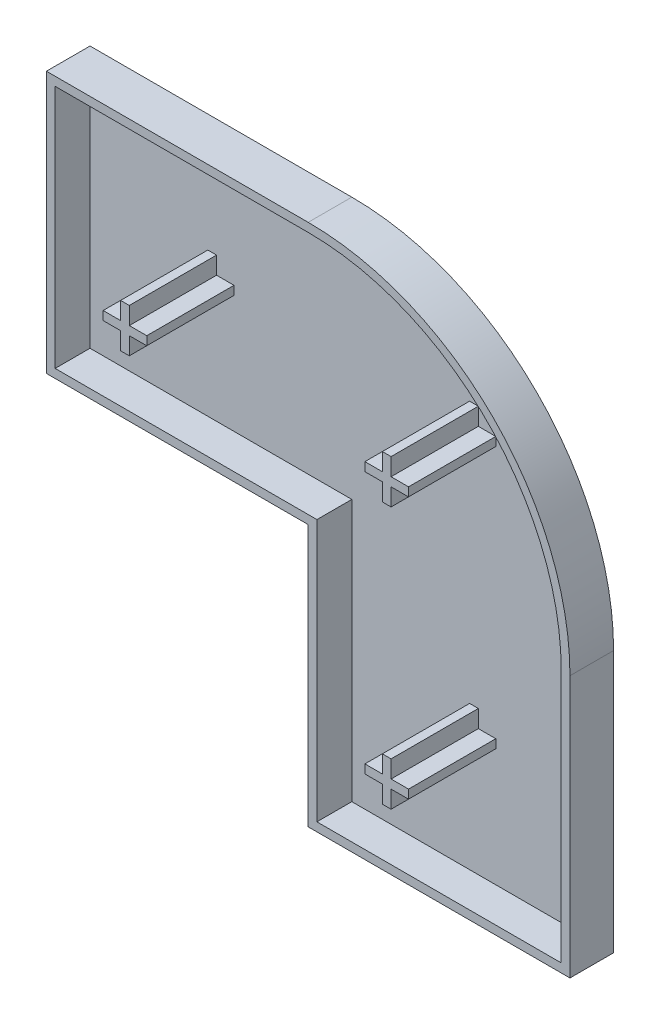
ISO-10303-21;
HEADER;
FILE_DESCRIPTION(('STEP AP214'),'2;1');
FILE_NAME('part.step','',(''),(''),'','','');
FILE_SCHEMA(('AUTOMOTIVE_DESIGN { 1 0 10303 214 1 1 1 1 }'));
ENDSEC;
DATA;
#1=APPLICATION_CONTEXT('core data for automotive mechanical design processes');
#2=APPLICATION_PROTOCOL_DEFINITION('international standard','automotive_design',2000,#1);
#3=PRODUCT_CONTEXT('',#1,'mechanical');
#4=PRODUCT('Part','Part','',(#3));
#5=PRODUCT_RELATED_PRODUCT_CATEGORY('part','',(#4));
#6=PRODUCT_DEFINITION_FORMATION('','',#4);
#7=PRODUCT_DEFINITION_CONTEXT('part definition',#1,'design');
#8=PRODUCT_DEFINITION('design','',#6,#7);
#9=PRODUCT_DEFINITION_SHAPE('','',#8);
#10=(LENGTH_UNIT() NAMED_UNIT(*) SI_UNIT(.MILLI.,.METRE.));
#11=(NAMED_UNIT(*) PLANE_ANGLE_UNIT() SI_UNIT($,.RADIAN.));
#12=(NAMED_UNIT(*) SI_UNIT($,.STERADIAN.) SOLID_ANGLE_UNIT());
#13=UNCERTAINTY_MEASURE_WITH_UNIT(LENGTH_MEASURE(1.E-05),#10,'distance_accuracy_value','');
#14=(GEOMETRIC_REPRESENTATION_CONTEXT(3) GLOBAL_UNCERTAINTY_ASSIGNED_CONTEXT((#13)) GLOBAL_UNIT_ASSIGNED_CONTEXT((#10,
#11,#12)) REPRESENTATION_CONTEXT('',''));
#15=CARTESIAN_POINT('',(0.,0.,0.));
#16=DIRECTION('',(0.,0.,1.));
#17=DIRECTION('',(1.,0.,0.));
#18=AXIS2_PLACEMENT_3D('',#15,#16,#17);
#19=CARTESIAN_POINT('',(0.,0.,-1.5));
#20=DIRECTION('',(0.,0.,1.));
#21=DIRECTION('',(1.,0.,0.));
#22=AXIS2_PLACEMENT_3D('',#19,#20,#21);
#23=PLANE('',#22);
#24=DIRECTION('',(1.,0.,0.));
#25=VECTOR('',#24,1.);
#26=CARTESIAN_POINT('',(-17.5,14.5,-1.5));
#27=LINE('',#26,#25);
#28=CARTESIAN_POINT('',(-17.5,14.5,-1.5));
#29=VERTEX_POINT('',#28);
#30=CARTESIAN_POINT('',(-15.5,14.5,-1.5));
#31=VERTEX_POINT('',#30);
#32=EDGE_CURVE('E379',#29,#31,#27,.T.);
#33=ORIENTED_EDGE('',*,*,#32,.F.);
#34=DIRECTION('',(0.,-1.,0.));
#35=VECTOR('',#34,1.);
#36=CARTESIAN_POINT('',(-17.5,15.5,-1.5));
#37=LINE('',#36,#35);
#38=CARTESIAN_POINT('',(-17.5,15.5,-1.5));
#39=VERTEX_POINT('',#38);
#40=EDGE_CURVE('E376',#39,#29,#37,.T.);
#41=ORIENTED_EDGE('',*,*,#40,.F.);
#42=DIRECTION('',(-1.,0.,0.));
#43=VECTOR('',#42,1.);
#44=CARTESIAN_POINT('',(-17.5,15.5,-1.5));
#45=LINE('',#44,#43);
#46=CARTESIAN_POINT('',(-15.5,15.5,-1.5));
#47=VERTEX_POINT('',#46);
#48=EDGE_CURVE('E389',#47,#39,#45,.T.);
#49=ORIENTED_EDGE('',*,*,#48,.F.);
#50=DIRECTION('',(0.,-1.,0.));
#51=VECTOR('',#50,1.);
#52=CARTESIAN_POINT('',(-15.5,17.5,-1.5));
#53=LINE('',#52,#51);
#54=CARTESIAN_POINT('',(-15.5,17.5,-1.5));
#55=VERTEX_POINT('',#54);
#56=EDGE_CURVE('E429',#55,#47,#53,.T.);
#57=ORIENTED_EDGE('',*,*,#56,.F.);
#58=DIRECTION('',(-1.,0.,0.));
#59=VECTOR('',#58,1.);
#60=CARTESIAN_POINT('',(-15.5,17.5,-1.5));
#61=LINE('',#60,#59);
#62=CARTESIAN_POINT('',(-14.5,17.5,-1.5));
#63=VERTEX_POINT('',#62);
#64=EDGE_CURVE('E427',#63,#55,#61,.T.);
#65=ORIENTED_EDGE('',*,*,#64,.F.);
#66=DIRECTION('',(0.,1.,0.));
#67=VECTOR('',#66,1.);
#68=CARTESIAN_POINT('',(-14.5,17.5,-1.5));
#69=LINE('',#68,#67);
#70=CARTESIAN_POINT('',(-14.5,15.5,-1.5));
#71=VERTEX_POINT('',#70);
#72=EDGE_CURVE('E425',#71,#63,#69,.T.);
#73=ORIENTED_EDGE('',*,*,#72,.F.);
#74=DIRECTION('',(-1.,0.,0.));
#75=VECTOR('',#74,1.);
#76=CARTESIAN_POINT('',(-14.5,15.5,-1.5));
#77=LINE('',#76,#75);
#78=CARTESIAN_POINT('',(-12.5,15.5,-1.5));
#79=VERTEX_POINT('',#78);
#80=EDGE_CURVE('E423',#79,#71,#77,.T.);
#81=ORIENTED_EDGE('',*,*,#80,.F.);
#82=DIRECTION('',(0.,1.,0.));
#83=VECTOR('',#82,1.);
#84=CARTESIAN_POINT('',(-12.5,15.5,-1.5));
#85=LINE('',#84,#83);
#86=CARTESIAN_POINT('',(-12.5,14.5,-1.5));
#87=VERTEX_POINT('',#86);
#88=EDGE_CURVE('E421',#87,#79,#85,.T.);
#89=ORIENTED_EDGE('',*,*,#88,.F.);
#90=DIRECTION('',(1.,0.,0.));
#91=VECTOR('',#90,1.);
#92=CARTESIAN_POINT('',(-14.5,14.5,-1.5));
#93=LINE('',#92,#91);
#94=CARTESIAN_POINT('',(-14.5,14.5,-1.5));
#95=VERTEX_POINT('',#94);
#96=EDGE_CURVE('E419',#95,#87,#93,.T.);
#97=ORIENTED_EDGE('',*,*,#96,.F.);
#98=DIRECTION('',(0.,1.,0.));
#99=VECTOR('',#98,1.);
#100=CARTESIAN_POINT('',(-14.5,14.5,-1.5));
#101=LINE('',#100,#99);
#102=CARTESIAN_POINT('',(-14.5,12.5,-1.5));
#103=VERTEX_POINT('',#102);
#104=EDGE_CURVE('E417',#103,#95,#101,.T.);
#105=ORIENTED_EDGE('',*,*,#104,.F.);
#106=DIRECTION('',(1.,0.,0.));
#107=VECTOR('',#106,1.);
#108=CARTESIAN_POINT('',(-15.5,12.5,-1.5));
#109=LINE('',#108,#107);
#110=CARTESIAN_POINT('',(-15.5,12.5,-1.5));
#111=VERTEX_POINT('',#110);
#112=EDGE_CURVE('E415',#111,#103,#109,.T.);
#113=ORIENTED_EDGE('',*,*,#112,.F.);
#114=DIRECTION('',(0.,-1.,0.));
#115=VECTOR('',#114,1.);
#116=CARTESIAN_POINT('',(-15.5,14.5,-1.5));
#117=LINE('',#116,#115);
#118=EDGE_CURVE('E413',#31,#111,#117,.T.);
#119=ORIENTED_EDGE('',*,*,#118,.F.);
#120=EDGE_LOOP('',(#33,#41,#49,#57,#65,#73,#81,#89,#97,#105,#113,#119));
#121=FACE_BOUND('',#120,.T.);
#122=DIRECTION('',(0.,-1.,0.));
#123=VECTOR('',#122,1.);
#124=CARTESIAN_POINT('',(-29.,30.,-1.5));
#125=LINE('',#124,#123);
#126=CARTESIAN_POINT('',(-29.,29.,-1.5));
#127=VERTEX_POINT('',#126);
#128=CARTESIAN_POINT('',(-29.,1.,-1.5));
#129=VERTEX_POINT('',#128);
#130=EDGE_CURVE('E549',#127,#129,#125,.T.);
#131=ORIENTED_EDGE('',*,*,#130,.T.);
#132=DIRECTION('',(1.,0.,0.));
#133=VECTOR('',#132,1.);
#134=CARTESIAN_POINT('',(0.,1.,-1.5));
#135=LINE('',#134,#133);
#136=CARTESIAN_POINT('',(1.,1.,-1.5));
#137=VERTEX_POINT('',#136);
#138=EDGE_CURVE('E552',#129,#137,#135,.T.);
#139=ORIENTED_EDGE('',*,*,#138,.T.);
#140=DIRECTION('',(0.,-1.,0.));
#141=VECTOR('',#140,1.);
#142=CARTESIAN_POINT('',(1.,0.,-1.5));
#143=LINE('',#142,#141);
#144=CARTESIAN_POINT('',(1.,-29.,-1.5));
#145=VERTEX_POINT('',#144);
#146=EDGE_CURVE('E564',#137,#145,#143,.T.);
#147=ORIENTED_EDGE('',*,*,#146,.T.);
#148=DIRECTION('',(1.,0.,0.));
#149=VECTOR('',#148,1.);
#150=CARTESIAN_POINT('',(0.,-29.,-1.5));
#151=LINE('',#150,#149);
#152=CARTESIAN_POINT('',(29.,-29.,-1.5));
#153=VERTEX_POINT('',#152);
#154=EDGE_CURVE('E569',#145,#153,#151,.T.);
#155=ORIENTED_EDGE('',*,*,#154,.T.);
#156=DIRECTION('',(0.,1.,0.));
#157=VECTOR('',#156,1.);
#158=CARTESIAN_POINT('',(29.,0.,-1.5));
#159=LINE('',#158,#157);
#160=CARTESIAN_POINT('',(29.,0.,-1.5));
#161=VERTEX_POINT('',#160);
#162=EDGE_CURVE('E574',#153,#161,#159,.T.);
#163=ORIENTED_EDGE('',*,*,#162,.T.);
#164=CARTESIAN_POINT('',(0.,0.,-1.5));
#165=DIRECTION('',(0.,0.,1.));
#166=DIRECTION('',(1.,0.,0.));
#167=AXIS2_PLACEMENT_3D('',#164,#165,#166);
#168=CIRCLE('',#167,29.);
#169=CARTESIAN_POINT('',(0.,29.,-1.5));
#170=VERTEX_POINT('',#169);
#171=EDGE_CURVE('E579',#161,#170,#168,.T.);
#172=ORIENTED_EDGE('',*,*,#171,.T.);
#173=DIRECTION('',(-1.,0.,0.));
#174=VECTOR('',#173,1.);
#175=CARTESIAN_POINT('',(-30.,29.,-1.5));
#176=LINE('',#175,#174);
#177=EDGE_CURVE('E583',#170,#127,#176,.T.);
#178=ORIENTED_EDGE('',*,*,#177,.T.);
#179=EDGE_LOOP('',(#131,#139,#147,#155,#163,#172,#178));
#180=FACE_BOUND('',#179,.T.);
#181=DIRECTION('',(1.,0.,0.));
#182=VECTOR('',#181,1.);
#183=CARTESIAN_POINT('',(12.5,14.5,-1.5));
#184=LINE('',#183,#182);
#185=CARTESIAN_POINT('',(12.5,14.5,-1.5));
#186=VERTEX_POINT('',#185);
#187=CARTESIAN_POINT('',(14.5,14.5,-1.5));
#188=VERTEX_POINT('',#187);
#189=EDGE_CURVE('E494',#186,#188,#184,.T.);
#190=ORIENTED_EDGE('',*,*,#189,.F.);
#191=DIRECTION('',(0.,-1.,0.));
#192=VECTOR('',#191,1.);
#193=CARTESIAN_POINT('',(12.5,15.5,-1.5));
#194=LINE('',#193,#192);
#195=CARTESIAN_POINT('',(12.5,15.5,-1.5));
#196=VERTEX_POINT('',#195);
#197=EDGE_CURVE('E464',#196,#186,#194,.T.);
#198=ORIENTED_EDGE('',*,*,#197,.F.);
#199=DIRECTION('',(-1.,0.,0.));
#200=VECTOR('',#199,1.);
#201=CARTESIAN_POINT('',(12.5,15.5,-1.5));
#202=LINE('',#201,#200);
#203=CARTESIAN_POINT('',(14.5,15.5,-1.5));
#204=VERTEX_POINT('',#203);
#205=EDGE_CURVE('E469',#204,#196,#202,.T.);
#206=ORIENTED_EDGE('',*,*,#205,.F.);
#207=DIRECTION('',(0.,-1.,0.));
#208=VECTOR('',#207,1.);
#209=CARTESIAN_POINT('',(14.5,17.5,-1.5));
#210=LINE('',#209,#208);
#211=CARTESIAN_POINT('',(14.5,17.5,-1.5));
#212=VERTEX_POINT('',#211);
#213=EDGE_CURVE('E512',#212,#204,#210,.T.);
#214=ORIENTED_EDGE('',*,*,#213,.F.);
#215=DIRECTION('',(-1.,0.,0.));
#216=VECTOR('',#215,1.);
#217=CARTESIAN_POINT('',(14.5,17.5,-1.5));
#218=LINE('',#217,#216);
#219=CARTESIAN_POINT('',(15.5,17.5,-1.5));
#220=VERTEX_POINT('',#219);
#221=EDGE_CURVE('E510',#220,#212,#218,.T.);
#222=ORIENTED_EDGE('',*,*,#221,.F.);
#223=DIRECTION('',(0.,1.,0.));
#224=VECTOR('',#223,1.);
#225=CARTESIAN_POINT('',(15.5,17.5,-1.5));
#226=LINE('',#225,#224);
#227=CARTESIAN_POINT('',(15.5,15.5,-1.5));
#228=VERTEX_POINT('',#227);
#229=EDGE_CURVE('E508',#228,#220,#226,.T.);
#230=ORIENTED_EDGE('',*,*,#229,.F.);
#231=DIRECTION('',(-1.,0.,0.));
#232=VECTOR('',#231,1.);
#233=CARTESIAN_POINT('',(15.5,15.5,-1.5));
#234=LINE('',#233,#232);
#235=CARTESIAN_POINT('',(17.5,15.5,-1.5));
#236=VERTEX_POINT('',#235);
#237=EDGE_CURVE('E506',#236,#228,#234,.T.);
#238=ORIENTED_EDGE('',*,*,#237,.F.);
#239=DIRECTION('',(0.,1.,0.));
#240=VECTOR('',#239,1.);
#241=CARTESIAN_POINT('',(17.5,15.5,-1.5));
#242=LINE('',#241,#240);
#243=CARTESIAN_POINT('',(17.5,14.5,-1.5));
#244=VERTEX_POINT('',#243);
#245=EDGE_CURVE('E504',#244,#236,#242,.T.);
#246=ORIENTED_EDGE('',*,*,#245,.F.);
#247=DIRECTION('',(1.,0.,0.));
#248=VECTOR('',#247,1.);
#249=CARTESIAN_POINT('',(15.5,14.5,-1.5));
#250=LINE('',#249,#248);
#251=CARTESIAN_POINT('',(15.5,14.5,-1.5));
#252=VERTEX_POINT('',#251);
#253=EDGE_CURVE('E502',#252,#244,#250,.T.);
#254=ORIENTED_EDGE('',*,*,#253,.F.);
#255=DIRECTION('',(0.,1.,0.));
#256=VECTOR('',#255,1.);
#257=CARTESIAN_POINT('',(15.5,14.5,-1.5));
#258=LINE('',#257,#256);
#259=CARTESIAN_POINT('',(15.5,12.5,-1.5));
#260=VERTEX_POINT('',#259);
#261=EDGE_CURVE('E500',#260,#252,#258,.T.);
#262=ORIENTED_EDGE('',*,*,#261,.F.);
#263=DIRECTION('',(1.,0.,0.));
#264=VECTOR('',#263,1.);
#265=CARTESIAN_POINT('',(14.5,12.5,-1.5));
#266=LINE('',#265,#264);
#267=CARTESIAN_POINT('',(14.5,12.5,-1.5));
#268=VERTEX_POINT('',#267);
#269=EDGE_CURVE('E498',#268,#260,#266,.T.);
#270=ORIENTED_EDGE('',*,*,#269,.F.);
#271=DIRECTION('',(0.,-1.,0.));
#272=VECTOR('',#271,1.);
#273=CARTESIAN_POINT('',(14.5,14.5,-1.5));
#274=LINE('',#273,#272);
#275=EDGE_CURVE('E496',#188,#268,#274,.T.);
#276=ORIENTED_EDGE('',*,*,#275,.F.);
#277=EDGE_LOOP('',(#190,#198,#206,#214,#222,#230,#238,#246,#254,#262,#270,#276));
#278=FACE_BOUND('',#277,.T.);
#279=DIRECTION('',(0.,-1.,0.));
#280=VECTOR('',#279,1.);
#281=CARTESIAN_POINT('',(12.5,-15.5,-1.5));
#282=LINE('',#281,#280);
#283=CARTESIAN_POINT('',(12.5,-14.5,-1.5));
#284=VERTEX_POINT('',#283);
#285=CARTESIAN_POINT('',(12.5,-15.5,-1.5));
#286=VERTEX_POINT('',#285);
#287=EDGE_CURVE('E764',#284,#286,#282,.T.);
#288=ORIENTED_EDGE('',*,*,#287,.F.);
#289=DIRECTION('',(-1.,0.,0.));
#290=VECTOR('',#289,1.);
#291=CARTESIAN_POINT('',(14.5,-14.5,-1.5));
#292=LINE('',#291,#290);
#293=CARTESIAN_POINT('',(14.5,-14.5,-1.5));
#294=VERTEX_POINT('',#293);
#295=EDGE_CURVE('E374',#294,#284,#292,.T.);
#296=ORIENTED_EDGE('',*,*,#295,.F.);
#297=DIRECTION('',(0.,-1.,0.));
#298=VECTOR('',#297,1.);
#299=CARTESIAN_POINT('',(14.5,-14.5,-1.5));
#300=LINE('',#299,#298);
#301=CARTESIAN_POINT('',(14.5,-12.5,-1.5));
#302=VERTEX_POINT('',#301);
#303=EDGE_CURVE('E370',#302,#294,#300,.T.);
#304=ORIENTED_EDGE('',*,*,#303,.F.);
#305=DIRECTION('',(-1.,0.,0.));
#306=VECTOR('',#305,1.);
#307=CARTESIAN_POINT('',(15.5,-12.5,-1.5));
#308=LINE('',#307,#306);
#309=CARTESIAN_POINT('',(15.5,-12.5,-1.5));
#310=VERTEX_POINT('',#309);
#311=EDGE_CURVE('E787',#310,#302,#308,.T.);
#312=ORIENTED_EDGE('',*,*,#311,.F.);
#313=DIRECTION('',(0.,1.,0.));
#314=VECTOR('',#313,1.);
#315=CARTESIAN_POINT('',(15.5,-14.5,-1.5));
#316=LINE('',#315,#314);
#317=CARTESIAN_POINT('',(15.5,-14.5,-1.5));
#318=VERTEX_POINT('',#317);
#319=EDGE_CURVE('E785',#318,#310,#316,.T.);
#320=ORIENTED_EDGE('',*,*,#319,.F.);
#321=DIRECTION('',(-1.,0.,0.));
#322=VECTOR('',#321,1.);
#323=CARTESIAN_POINT('',(17.5,-14.5,-1.5));
#324=LINE('',#323,#322);
#325=CARTESIAN_POINT('',(17.5,-14.5,-1.5));
#326=VERTEX_POINT('',#325);
#327=EDGE_CURVE('E783',#326,#318,#324,.T.);
#328=ORIENTED_EDGE('',*,*,#327,.F.);
#329=DIRECTION('',(0.,1.,0.));
#330=VECTOR('',#329,1.);
#331=CARTESIAN_POINT('',(17.5,-15.5,-1.5));
#332=LINE('',#331,#330);
#333=CARTESIAN_POINT('',(17.5,-15.5,-1.5));
#334=VERTEX_POINT('',#333);
#335=EDGE_CURVE('E781',#334,#326,#332,.T.);
#336=ORIENTED_EDGE('',*,*,#335,.F.);
#337=DIRECTION('',(1.,0.,0.));
#338=VECTOR('',#337,1.);
#339=CARTESIAN_POINT('',(17.5,-15.5,-1.5));
#340=LINE('',#339,#338);
#341=CARTESIAN_POINT('',(15.5,-15.5,-1.5));
#342=VERTEX_POINT('',#341);
#343=EDGE_CURVE('E779',#342,#334,#340,.T.);
#344=ORIENTED_EDGE('',*,*,#343,.F.);
#345=DIRECTION('',(0.,1.,0.));
#346=VECTOR('',#345,1.);
#347=CARTESIAN_POINT('',(15.5,-17.5,-1.5));
#348=LINE('',#347,#346);
#349=CARTESIAN_POINT('',(15.5,-17.5,-1.5));
#350=VERTEX_POINT('',#349);
#351=EDGE_CURVE('E777',#350,#342,#348,.T.);
#352=ORIENTED_EDGE('',*,*,#351,.F.);
#353=DIRECTION('',(1.,0.,0.));
#354=VECTOR('',#353,1.);
#355=CARTESIAN_POINT('',(15.5,-17.5,-1.5));
#356=LINE('',#355,#354);
#357=CARTESIAN_POINT('',(14.5,-17.5,-1.5));
#358=VERTEX_POINT('',#357);
#359=EDGE_CURVE('E775',#358,#350,#356,.T.);
#360=ORIENTED_EDGE('',*,*,#359,.F.);
#361=DIRECTION('',(0.,-1.,0.));
#362=VECTOR('',#361,1.);
#363=CARTESIAN_POINT('',(14.5,-17.5,-1.5));
#364=LINE('',#363,#362);
#365=CARTESIAN_POINT('',(14.5,-15.5,-1.5));
#366=VERTEX_POINT('',#365);
#367=EDGE_CURVE('E769',#366,#358,#364,.T.);
#368=ORIENTED_EDGE('',*,*,#367,.F.);
#369=DIRECTION('',(1.,0.,0.));
#370=VECTOR('',#369,1.);
#371=CARTESIAN_POINT('',(14.5,-15.5,-1.5));
#372=LINE('',#371,#370);
#373=EDGE_CURVE('E767',#286,#366,#372,.T.);
#374=ORIENTED_EDGE('',*,*,#373,.F.);
#375=EDGE_LOOP('',(#288,#296,#304,#312,#320,#328,#336,#344,#352,#360,#368,#374));
#376=FACE_BOUND('',#375,.T.);
#377=ADVANCED_FACE('F33',(#121,#180,#278,#376),#23,.T.);
#378=CARTESIAN_POINT('',(-30.,30.,2.5));
#379=DIRECTION('',(1.,0.,0.));
#380=DIRECTION('',(0.,1.,0.));
#381=AXIS2_PLACEMENT_3D('',#378,#379,#380);
#382=PLANE('',#381);
#383=DIRECTION('',(0.,-1.,0.));
#384=VECTOR('',#383,1.);
#385=CARTESIAN_POINT('',(-30.,30.,-2.5));
#386=LINE('',#385,#384);
#387=CARTESIAN_POINT('',(-30.,30.,-2.5));
#388=VERTEX_POINT('',#387);
#389=CARTESIAN_POINT('',(-30.,0.,-2.5));
#390=VERTEX_POINT('',#389);
#391=EDGE_CURVE('E556',#388,#390,#386,.T.);
#392=ORIENTED_EDGE('',*,*,#391,.T.);
#393=DIRECTION('',(0.,0.,-1.));
#394=VECTOR('',#393,1.);
#395=CARTESIAN_POINT('',(-30.,0.,2.5));
#396=LINE('',#395,#394);
#397=CARTESIAN_POINT('',(-30.,0.,2.5));
#398=VERTEX_POINT('',#397);
#399=EDGE_CURVE('E11',#398,#390,#396,.T.);
#400=ORIENTED_EDGE('',*,*,#399,.F.);
#401=DIRECTION('',(0.,-1.,0.));
#402=VECTOR('',#401,1.);
#403=CARTESIAN_POINT('',(-30.,30.,2.5));
#404=LINE('',#403,#402);
#405=CARTESIAN_POINT('',(-30.,30.,2.5));
#406=VERTEX_POINT('',#405);
#407=EDGE_CURVE('E601',#406,#398,#404,.T.);
#408=ORIENTED_EDGE('',*,*,#407,.F.);
#409=DIRECTION('',(0.,0.,-1.));
#410=VECTOR('',#409,1.);
#411=CARTESIAN_POINT('',(-30.,30.,2.5));
#412=LINE('',#411,#410);
#413=EDGE_CURVE('E617',#406,#388,#412,.T.);
#414=ORIENTED_EDGE('',*,*,#413,.T.);
#415=EDGE_LOOP('',(#392,#400,#408,#414));
#416=FACE_BOUND('',#415,.T.);
#417=ADVANCED_FACE('F35',(#416),#382,.F.);
#418=CARTESIAN_POINT('',(0.,0.,2.5));
#419=DIRECTION('',(0.,1.,0.));
#420=DIRECTION('',(0.,0.,1.));
#421=AXIS2_PLACEMENT_3D('',#418,#419,#420);
#422=PLANE('',#421);
#423=DIRECTION('',(1.,0.,0.));
#424=VECTOR('',#423,1.);
#425=CARTESIAN_POINT('',(0.,0.,-2.5));
#426=LINE('',#425,#424);
#427=CARTESIAN_POINT('',(0.,0.,-2.5));
#428=VERTEX_POINT('',#427);
#429=EDGE_CURVE('E620',#390,#428,#426,.T.);
#430=ORIENTED_EDGE('',*,*,#429,.T.);
#431=DIRECTION('',(0.,0.,-1.));
#432=VECTOR('',#431,1.);
#433=CARTESIAN_POINT('',(0.,0.,2.5));
#434=LINE('',#433,#432);
#435=CARTESIAN_POINT('',(0.,0.,2.5));
#436=VERTEX_POINT('',#435);
#437=EDGE_CURVE('E41',#436,#428,#434,.T.);
#438=ORIENTED_EDGE('',*,*,#437,.F.);
#439=DIRECTION('',(1.,0.,0.));
#440=VECTOR('',#439,1.);
#441=CARTESIAN_POINT('',(0.,0.,2.5));
#442=LINE('',#441,#440);
#443=EDGE_CURVE('E604',#398,#436,#442,.T.);
#444=ORIENTED_EDGE('',*,*,#443,.F.);
#445=ORIENTED_EDGE('',*,*,#399,.T.);
#446=EDGE_LOOP('',(#430,#438,#444,#445));
#447=FACE_BOUND('',#446,.T.);
#448=ADVANCED_FACE('F672',(#447),#422,.F.);
#449=CARTESIAN_POINT('',(0.,0.,2.5));
#450=DIRECTION('',(1.,0.,0.));
#451=DIRECTION('',(0.,0.,-1.));
#452=AXIS2_PLACEMENT_3D('',#449,#450,#451);
#453=PLANE('',#452);
#454=DIRECTION('',(0.,-1.,0.));
#455=VECTOR('',#454,1.);
#456=CARTESIAN_POINT('',(0.,0.,-2.5));
#457=LINE('',#456,#455);
#458=CARTESIAN_POINT('',(0.,-30.,-2.5));
#459=VERTEX_POINT('',#458);
#460=EDGE_CURVE('E622',#428,#459,#457,.T.);
#461=ORIENTED_EDGE('',*,*,#460,.T.);
#462=DIRECTION('',(0.,0.,-1.));
#463=VECTOR('',#462,1.);
#464=CARTESIAN_POINT('',(0.,-30.,2.5));
#465=LINE('',#464,#463);
#466=CARTESIAN_POINT('',(0.,-30.,2.5));
#467=VERTEX_POINT('',#466);
#468=EDGE_CURVE('E642',#467,#459,#465,.T.);
#469=ORIENTED_EDGE('',*,*,#468,.F.);
#470=DIRECTION('',(0.,-1.,0.));
#471=VECTOR('',#470,1.);
#472=CARTESIAN_POINT('',(0.,0.,2.5));
#473=LINE('',#472,#471);
#474=EDGE_CURVE('E607',#436,#467,#473,.T.);
#475=ORIENTED_EDGE('',*,*,#474,.F.);
#476=ORIENTED_EDGE('',*,*,#437,.T.);
#477=EDGE_LOOP('',(#461,#469,#475,#476));
#478=FACE_BOUND('',#477,.T.);
#479=ADVANCED_FACE('F649',(#478),#453,.F.);
#480=CARTESIAN_POINT('',(0.,-30.,2.5));
#481=DIRECTION('',(0.,1.,0.));
#482=DIRECTION('',(0.,0.,1.));
#483=AXIS2_PLACEMENT_3D('',#480,#481,#482);
#484=PLANE('',#483);
#485=DIRECTION('',(1.,0.,0.));
#486=VECTOR('',#485,1.);
#487=CARTESIAN_POINT('',(0.,-30.,-2.5));
#488=LINE('',#487,#486);
#489=CARTESIAN_POINT('',(30.,-30.,-2.5));
#490=VERTEX_POINT('',#489);
#491=EDGE_CURVE('E624',#459,#490,#488,.T.);
#492=ORIENTED_EDGE('',*,*,#491,.T.);
#493=DIRECTION('',(0.,0.,-1.));
#494=VECTOR('',#493,1.);
#495=CARTESIAN_POINT('',(30.,-30.,2.5));
#496=LINE('',#495,#494);
#497=CARTESIAN_POINT('',(30.,-30.,2.5));
#498=VERTEX_POINT('',#497);
#499=EDGE_CURVE('E639',#498,#490,#496,.T.);
#500=ORIENTED_EDGE('',*,*,#499,.F.);
#501=DIRECTION('',(1.,0.,0.));
#502=VECTOR('',#501,1.);
#503=CARTESIAN_POINT('',(0.,-30.,2.5));
#504=LINE('',#503,#502);
#505=EDGE_CURVE('E609',#467,#498,#504,.T.);
#506=ORIENTED_EDGE('',*,*,#505,.F.);
#507=ORIENTED_EDGE('',*,*,#468,.T.);
#508=EDGE_LOOP('',(#492,#500,#506,#507));
#509=FACE_BOUND('',#508,.T.);
#510=ADVANCED_FACE('F660',(#509),#484,.F.);
#511=CARTESIAN_POINT('',(30.,0.,2.5));
#512=DIRECTION('',(-1.,0.,0.));
#513=DIRECTION('',(0.,-1.,0.));
#514=AXIS2_PLACEMENT_3D('',#511,#512,#513);
#515=PLANE('',#514);
#516=DIRECTION('',(0.,1.,0.));
#517=VECTOR('',#516,1.);
#518=CARTESIAN_POINT('',(30.,0.,-2.5));
#519=LINE('',#518,#517);
#520=CARTESIAN_POINT('',(30.,0.,-2.5));
#521=VERTEX_POINT('',#520);
#522=EDGE_CURVE('E626',#490,#521,#519,.T.);
#523=ORIENTED_EDGE('',*,*,#522,.T.);
#524=DIRECTION('',(0.,0.,-1.));
#525=VECTOR('',#524,1.);
#526=CARTESIAN_POINT('',(30.,0.,2.5));
#527=LINE('',#526,#525);
#528=CARTESIAN_POINT('',(30.,0.,2.5));
#529=VERTEX_POINT('',#528);
#530=EDGE_CURVE('E636',#529,#521,#527,.T.);
#531=ORIENTED_EDGE('',*,*,#530,.F.);
#532=DIRECTION('',(0.,1.,0.));
#533=VECTOR('',#532,1.);
#534=CARTESIAN_POINT('',(30.,0.,2.5));
#535=LINE('',#534,#533);
#536=EDGE_CURVE('E611',#498,#529,#535,.T.);
#537=ORIENTED_EDGE('',*,*,#536,.F.);
#538=ORIENTED_EDGE('',*,*,#499,.T.);
#539=EDGE_LOOP('',(#523,#531,#537,#538));
#540=FACE_BOUND('',#539,.T.);
#541=ADVANCED_FACE('F664',(#540),#515,.F.);
#542=CARTESIAN_POINT('',(0.,0.,2.5));
#543=DIRECTION('',(0.,0.,-1.));
#544=DIRECTION('',(-1.,0.,0.));
#545=AXIS2_PLACEMENT_3D('',#542,#543,#544);
#546=CYLINDRICAL_SURFACE('',#545,30.);
#547=CARTESIAN_POINT('',(0.,0.,-2.5));
#548=DIRECTION('',(0.,0.,1.));
#549=DIRECTION('',(1.,0.,0.));
#550=AXIS2_PLACEMENT_3D('',#547,#548,#549);
#551=CIRCLE('',#550,30.);
#552=CARTESIAN_POINT('',(0.,30.,-2.5));
#553=VERTEX_POINT('',#552);
#554=EDGE_CURVE('E628',#521,#553,#551,.T.);
#555=ORIENTED_EDGE('',*,*,#554,.T.);
#556=DIRECTION('',(0.,0.,-1.));
#557=VECTOR('',#556,1.);
#558=CARTESIAN_POINT('',(0.,30.,2.5));
#559=LINE('',#558,#557);
#560=CARTESIAN_POINT('',(0.,30.,2.5));
#561=VERTEX_POINT('',#560);
#562=EDGE_CURVE('E633',#561,#553,#559,.T.);
#563=ORIENTED_EDGE('',*,*,#562,.F.);
#564=CARTESIAN_POINT('',(0.,0.,2.5));
#565=DIRECTION('',(0.,0.,1.));
#566=DIRECTION('',(1.,0.,0.));
#567=AXIS2_PLACEMENT_3D('',#564,#565,#566);
#568=CIRCLE('',#567,30.);
#569=EDGE_CURVE('E613',#529,#561,#568,.T.);
#570=ORIENTED_EDGE('',*,*,#569,.F.);
#571=ORIENTED_EDGE('',*,*,#530,.T.);
#572=EDGE_LOOP('',(#555,#563,#570,#571));
#573=FACE_BOUND('',#572,.T.);
#574=ADVANCED_FACE('F680',(#573),#546,.T.);
#575=CARTESIAN_POINT('',(-30.,30.,2.5));
#576=DIRECTION('',(0.,-1.,0.));
#577=DIRECTION('',(0.,0.,-1.));
#578=AXIS2_PLACEMENT_3D('',#575,#576,#577);
#579=PLANE('',#578);
#580=DIRECTION('',(-1.,0.,0.));
#581=VECTOR('',#580,1.);
#582=CARTESIAN_POINT('',(-30.,30.,-2.5));
#583=LINE('',#582,#581);
#584=EDGE_CURVE('E605',#553,#388,#583,.T.);
#585=ORIENTED_EDGE('',*,*,#584,.T.);
#586=ORIENTED_EDGE('',*,*,#413,.F.);
#587=DIRECTION('',(-1.,0.,0.));
#588=VECTOR('',#587,1.);
#589=CARTESIAN_POINT('',(-30.,30.,2.5));
#590=LINE('',#589,#588);
#591=EDGE_CURVE('E615',#561,#406,#590,.T.);
#592=ORIENTED_EDGE('',*,*,#591,.F.);
#593=ORIENTED_EDGE('',*,*,#562,.T.);
#594=EDGE_LOOP('',(#585,#586,#592,#593));
#595=FACE_BOUND('',#594,.T.);
#596=ADVANCED_FACE('F677',(#595),#579,.F.);
#597=CARTESIAN_POINT('',(0.,0.,2.5));
#598=DIRECTION('',(0.,0.,1.));
#599=DIRECTION('',(1.,0.,0.));
#600=AXIS2_PLACEMENT_3D('',#597,#598,#599);
#601=PLANE('',#600);
#602=DIRECTION('',(0.,-1.,0.));
#603=VECTOR('',#602,1.);
#604=CARTESIAN_POINT('',(-29.,30.,2.5));
#605=LINE('',#604,#603);
#606=CARTESIAN_POINT('',(-29.,29.,2.5));
#607=VERTEX_POINT('',#606);
#608=CARTESIAN_POINT('',(-29.,1.,2.5));
#609=VERTEX_POINT('',#608);
#610=EDGE_CURVE('E587',#607,#609,#605,.T.);
#611=ORIENTED_EDGE('',*,*,#610,.F.);
#612=DIRECTION('',(-1.,0.,0.));
#613=VECTOR('',#612,1.);
#614=CARTESIAN_POINT('',(-30.,29.,2.5));
#615=LINE('',#614,#613);
#616=CARTESIAN_POINT('',(0.,29.,2.5));
#617=VERTEX_POINT('',#616);
#618=EDGE_CURVE('E562',#617,#607,#615,.T.);
#619=ORIENTED_EDGE('',*,*,#618,.F.);
#620=CARTESIAN_POINT('',(0.,0.,2.5));
#621=DIRECTION('',(0.,0.,1.));
#622=DIRECTION('',(1.,0.,0.));
#623=AXIS2_PLACEMENT_3D('',#620,#621,#622);
#624=CIRCLE('',#623,29.);
#625=CARTESIAN_POINT('',(29.,0.,2.5));
#626=VERTEX_POINT('',#625);
#627=EDGE_CURVE('E597',#626,#617,#624,.T.);
#628=ORIENTED_EDGE('',*,*,#627,.F.);
#629=DIRECTION('',(0.,1.,0.));
#630=VECTOR('',#629,1.);
#631=CARTESIAN_POINT('',(29.,0.,2.5));
#632=LINE('',#631,#630);
#633=CARTESIAN_POINT('',(29.,-29.,2.5));
#634=VERTEX_POINT('',#633);
#635=EDGE_CURVE('E595',#634,#626,#632,.T.);
#636=ORIENTED_EDGE('',*,*,#635,.F.);
#637=DIRECTION('',(1.,0.,0.));
#638=VECTOR('',#637,1.);
#639=CARTESIAN_POINT('',(0.,-29.,2.5));
#640=LINE('',#639,#638);
#641=CARTESIAN_POINT('',(1.,-29.,2.5));
#642=VERTEX_POINT('',#641);
#643=EDGE_CURVE('E593',#642,#634,#640,.T.);
#644=ORIENTED_EDGE('',*,*,#643,.F.);
#645=DIRECTION('',(0.,-1.,0.));
#646=VECTOR('',#645,1.);
#647=CARTESIAN_POINT('',(1.,0.,2.5));
#648=LINE('',#647,#646);
#649=CARTESIAN_POINT('',(1.,1.,2.5));
#650=VERTEX_POINT('',#649);
#651=EDGE_CURVE('E591',#650,#642,#648,.T.);
#652=ORIENTED_EDGE('',*,*,#651,.F.);
#653=DIRECTION('',(1.,0.,0.));
#654=VECTOR('',#653,1.);
#655=CARTESIAN_POINT('',(0.,1.,2.5));
#656=LINE('',#655,#654);
#657=EDGE_CURVE('E589',#609,#650,#656,.T.);
#658=ORIENTED_EDGE('',*,*,#657,.F.);
#659=EDGE_LOOP('',(#611,#619,#628,#636,#644,#652,#658));
#660=FACE_BOUND('',#659,.T.);
#661=ORIENTED_EDGE('',*,*,#407,.T.);
#662=ORIENTED_EDGE('',*,*,#443,.T.);
#663=ORIENTED_EDGE('',*,*,#474,.T.);
#664=ORIENTED_EDGE('',*,*,#505,.T.);
#665=ORIENTED_EDGE('',*,*,#536,.T.);
#666=ORIENTED_EDGE('',*,*,#569,.T.);
#667=ORIENTED_EDGE('',*,*,#591,.T.);
#668=EDGE_LOOP('',(#661,#662,#663,#664,#665,#666,#667));
#669=FACE_BOUND('',#668,.T.);
#670=ADVANCED_FACE('F668',(#660,#669),#601,.T.);
#671=CARTESIAN_POINT('',(0.,0.,-2.5));
#672=DIRECTION('',(0.,0.,1.));
#673=DIRECTION('',(1.,0.,0.));
#674=AXIS2_PLACEMENT_3D('',#671,#672,#673);
#675=PLANE('',#674);
#676=ORIENTED_EDGE('',*,*,#391,.F.);
#677=ORIENTED_EDGE('',*,*,#584,.F.);
#678=ORIENTED_EDGE('',*,*,#554,.F.);
#679=ORIENTED_EDGE('',*,*,#522,.F.);
#680=ORIENTED_EDGE('',*,*,#491,.F.);
#681=ORIENTED_EDGE('',*,*,#460,.F.);
#682=ORIENTED_EDGE('',*,*,#429,.F.);
#683=EDGE_LOOP('',(#676,#677,#678,#679,#680,#681,#682));
#684=FACE_BOUND('',#683,.T.);
#685=ADVANCED_FACE('F655',(#684),#675,.F.);
#686=CARTESIAN_POINT('',(-29.,30.,2.5));
#687=DIRECTION('',(1.,0.,0.));
#688=DIRECTION('',(0.,1.,0.));
#689=AXIS2_PLACEMENT_3D('',#686,#687,#688);
#690=PLANE('',#689);
#691=ORIENTED_EDGE('',*,*,#130,.F.);
#692=DIRECTION('',(0.,0.,-1.));
#693=VECTOR('',#692,1.);
#694=CARTESIAN_POINT('',(-29.,29.,2.5));
#695=LINE('',#694,#693);
#696=EDGE_CURVE('E558',#607,#127,#695,.T.);
#697=ORIENTED_EDGE('',*,*,#696,.F.);
#698=ORIENTED_EDGE('',*,*,#610,.T.);
#699=DIRECTION('',(0.,0.,-1.));
#700=VECTOR('',#699,1.);
#701=CARTESIAN_POINT('',(-29.,1.,2.5));
#702=LINE('',#701,#700);
#703=EDGE_CURVE('E553',#609,#129,#702,.T.);
#704=ORIENTED_EDGE('',*,*,#703,.T.);
#705=EDGE_LOOP('',(#691,#697,#698,#704));
#706=FACE_BOUND('',#705,.T.);
#707=ADVANCED_FACE('F705',(#706),#690,.T.);
#708=CARTESIAN_POINT('',(0.,1.,2.5));
#709=DIRECTION('',(0.,1.,0.));
#710=DIRECTION('',(0.,0.,1.));
#711=AXIS2_PLACEMENT_3D('',#708,#709,#710);
#712=PLANE('',#711);
#713=ORIENTED_EDGE('',*,*,#138,.F.);
#714=ORIENTED_EDGE('',*,*,#703,.F.);
#715=ORIENTED_EDGE('',*,*,#657,.T.);
#716=DIRECTION('',(0.,0.,-1.));
#717=VECTOR('',#716,1.);
#718=CARTESIAN_POINT('',(1.,1.,2.5));
#719=LINE('',#718,#717);
#720=EDGE_CURVE('E557',#650,#137,#719,.T.);
#721=ORIENTED_EDGE('',*,*,#720,.T.);
#722=EDGE_LOOP('',(#713,#714,#715,#721));
#723=FACE_BOUND('',#722,.T.);
#724=ADVANCED_FACE('F709',(#723),#712,.T.);
#725=CARTESIAN_POINT('',(1.,0.,2.5));
#726=DIRECTION('',(1.,0.,0.));
#727=DIRECTION('',(0.,0.,-1.));
#728=AXIS2_PLACEMENT_3D('',#725,#726,#727);
#729=PLANE('',#728);
#730=ORIENTED_EDGE('',*,*,#146,.F.);
#731=ORIENTED_EDGE('',*,*,#720,.F.);
#732=ORIENTED_EDGE('',*,*,#651,.T.);
#733=DIRECTION('',(0.,0.,-1.));
#734=VECTOR('',#733,1.);
#735=CARTESIAN_POINT('',(1.,-29.,2.5));
#736=LINE('',#735,#734);
#737=EDGE_CURVE('E567',#642,#145,#736,.T.);
#738=ORIENTED_EDGE('',*,*,#737,.T.);
#739=EDGE_LOOP('',(#730,#731,#732,#738));
#740=FACE_BOUND('',#739,.T.);
#741=ADVANCED_FACE('F715',(#740),#729,.T.);
#742=CARTESIAN_POINT('',(0.,-29.,2.5));
#743=DIRECTION('',(0.,1.,0.));
#744=DIRECTION('',(0.,0.,1.));
#745=AXIS2_PLACEMENT_3D('',#742,#743,#744);
#746=PLANE('',#745);
#747=ORIENTED_EDGE('',*,*,#154,.F.);
#748=ORIENTED_EDGE('',*,*,#737,.F.);
#749=ORIENTED_EDGE('',*,*,#643,.T.);
#750=DIRECTION('',(0.,0.,-1.));
#751=VECTOR('',#750,1.);
#752=CARTESIAN_POINT('',(29.,-29.,2.5));
#753=LINE('',#752,#751);
#754=EDGE_CURVE('E572',#634,#153,#753,.T.);
#755=ORIENTED_EDGE('',*,*,#754,.T.);
#756=EDGE_LOOP('',(#747,#748,#749,#755));
#757=FACE_BOUND('',#756,.T.);
#758=ADVANCED_FACE('F725',(#757),#746,.T.);
#759=CARTESIAN_POINT('',(29.,0.,2.5));
#760=DIRECTION('',(-1.,0.,0.));
#761=DIRECTION('',(0.,-1.,0.));
#762=AXIS2_PLACEMENT_3D('',#759,#760,#761);
#763=PLANE('',#762);
#764=ORIENTED_EDGE('',*,*,#162,.F.);
#765=ORIENTED_EDGE('',*,*,#754,.F.);
#766=ORIENTED_EDGE('',*,*,#635,.T.);
#767=DIRECTION('',(0.,0.,-1.));
#768=VECTOR('',#767,1.);
#769=CARTESIAN_POINT('',(29.,0.,2.5));
#770=LINE('',#769,#768);
#771=EDGE_CURVE('E577',#626,#161,#770,.T.);
#772=ORIENTED_EDGE('',*,*,#771,.T.);
#773=EDGE_LOOP('',(#764,#765,#766,#772));
#774=FACE_BOUND('',#773,.T.);
#775=ADVANCED_FACE('F729',(#774),#763,.T.);
#776=CARTESIAN_POINT('',(0.,0.,2.5));
#777=DIRECTION('',(0.,0.,-1.));
#778=DIRECTION('',(-1.,0.,0.));
#779=AXIS2_PLACEMENT_3D('',#776,#777,#778);
#780=CYLINDRICAL_SURFACE('',#779,29.);
#781=ORIENTED_EDGE('',*,*,#171,.F.);
#782=ORIENTED_EDGE('',*,*,#771,.F.);
#783=ORIENTED_EDGE('',*,*,#627,.T.);
#784=DIRECTION('',(0.,0.,-1.));
#785=VECTOR('',#784,1.);
#786=CARTESIAN_POINT('',(0.,29.,2.5));
#787=LINE('',#786,#785);
#788=EDGE_CURVE('E561',#617,#170,#787,.T.);
#789=ORIENTED_EDGE('',*,*,#788,.T.);
#790=EDGE_LOOP('',(#781,#782,#783,#789));
#791=FACE_BOUND('',#790,.T.);
#792=ADVANCED_FACE('F732',(#791),#780,.F.);
#793=CARTESIAN_POINT('',(-30.,29.,2.5));
#794=DIRECTION('',(0.,-1.,0.));
#795=DIRECTION('',(0.,0.,-1.));
#796=AXIS2_PLACEMENT_3D('',#793,#794,#795);
#797=PLANE('',#796);
#798=ORIENTED_EDGE('',*,*,#177,.F.);
#799=ORIENTED_EDGE('',*,*,#788,.F.);
#800=ORIENTED_EDGE('',*,*,#618,.T.);
#801=ORIENTED_EDGE('',*,*,#696,.T.);
#802=EDGE_LOOP('',(#798,#799,#800,#801));
#803=FACE_BOUND('',#802,.T.);
#804=ADVANCED_FACE('F699',(#803),#797,.T.);
#805=CARTESIAN_POINT('',(12.5,15.5,8.5));
#806=DIRECTION('',(1.,0.,0.));
#807=DIRECTION('',(0.,0.,-1.));
#808=AXIS2_PLACEMENT_3D('',#805,#806,#807);
#809=PLANE('',#808);
#810=ORIENTED_EDGE('',*,*,#197,.T.);
#811=DIRECTION('',(0.,0.,-1.));
#812=VECTOR('',#811,1.);
#813=CARTESIAN_POINT('',(12.5,14.5,8.5));
#814=LINE('',#813,#812);
#815=CARTESIAN_POINT('',(12.5,14.5,8.5));
#816=VERTEX_POINT('',#815);
#817=EDGE_CURVE('E547',#816,#186,#814,.T.);
#818=ORIENTED_EDGE('',*,*,#817,.F.);
#819=DIRECTION('',(0.,-1.,0.));
#820=VECTOR('',#819,1.);
#821=CARTESIAN_POINT('',(12.5,15.5,8.5));
#822=LINE('',#821,#820);
#823=CARTESIAN_POINT('',(12.5,15.5,8.5));
#824=VERTEX_POINT('',#823);
#825=EDGE_CURVE('E465',#824,#816,#822,.T.);
#826=ORIENTED_EDGE('',*,*,#825,.F.);
#827=DIRECTION('',(0.,0.,-1.));
#828=VECTOR('',#827,1.);
#829=CARTESIAN_POINT('',(12.5,15.5,8.5));
#830=LINE('',#829,#828);
#831=EDGE_CURVE('E491',#824,#196,#830,.T.);
#832=ORIENTED_EDGE('',*,*,#831,.T.);
#833=EDGE_LOOP('',(#810,#818,#826,#832));
#834=FACE_BOUND('',#833,.T.);
#835=ADVANCED_FACE('F720',(#834),#809,.F.);
#836=CARTESIAN_POINT('',(12.5,14.5,8.5));
#837=DIRECTION('',(0.,1.,0.));
#838=DIRECTION('',(0.,0.,1.));
#839=AXIS2_PLACEMENT_3D('',#836,#837,#838);
#840=PLANE('',#839);
#841=ORIENTED_EDGE('',*,*,#189,.T.);
#842=DIRECTION('',(0.,0.,-1.));
#843=VECTOR('',#842,1.);
#844=CARTESIAN_POINT('',(14.5,14.5,8.5));
#845=LINE('',#844,#843);
#846=CARTESIAN_POINT('',(14.5,14.5,8.5));
#847=VERTEX_POINT('',#846);
#848=EDGE_CURVE('E544',#847,#188,#845,.T.);
#849=ORIENTED_EDGE('',*,*,#848,.F.);
#850=DIRECTION('',(1.,0.,0.));
#851=VECTOR('',#850,1.);
#852=CARTESIAN_POINT('',(12.5,14.5,8.5));
#853=LINE('',#852,#851);
#854=EDGE_CURVE('E468',#816,#847,#853,.T.);
#855=ORIENTED_EDGE('',*,*,#854,.F.);
#856=ORIENTED_EDGE('',*,*,#817,.T.);
#857=EDGE_LOOP('',(#841,#849,#855,#856));
#858=FACE_BOUND('',#857,.T.);
#859=ADVANCED_FACE('F985',(#858),#840,.F.);
#860=CARTESIAN_POINT('',(14.5,14.5,8.5));
#861=DIRECTION('',(1.,0.,0.));
#862=DIRECTION('',(0.,1.,0.));
#863=AXIS2_PLACEMENT_3D('',#860,#861,#862);
#864=PLANE('',#863);
#865=ORIENTED_EDGE('',*,*,#275,.T.);
#866=DIRECTION('',(0.,0.,-1.));
#867=VECTOR('',#866,1.);
#868=CARTESIAN_POINT('',(14.5,12.5,8.5));
#869=LINE('',#868,#867);
#870=CARTESIAN_POINT('',(14.5,12.5,8.5));
#871=VERTEX_POINT('',#870);
#872=EDGE_CURVE('E541',#871,#268,#869,.T.);
#873=ORIENTED_EDGE('',*,*,#872,.F.);
#874=DIRECTION('',(0.,-1.,0.));
#875=VECTOR('',#874,1.);
#876=CARTESIAN_POINT('',(14.5,14.5,8.5));
#877=LINE('',#876,#875);
#878=EDGE_CURVE('E471',#847,#871,#877,.T.);
#879=ORIENTED_EDGE('',*,*,#878,.F.);
#880=ORIENTED_EDGE('',*,*,#848,.T.);
#881=EDGE_LOOP('',(#865,#873,#879,#880));
#882=FACE_BOUND('',#881,.T.);
#883=ADVANCED_FACE('F982',(#882),#864,.F.);
#884=CARTESIAN_POINT('',(14.5,12.5,8.5));
#885=DIRECTION('',(0.,1.,0.));
#886=DIRECTION('',(0.,0.,1.));
#887=AXIS2_PLACEMENT_3D('',#884,#885,#886);
#888=PLANE('',#887);
#889=ORIENTED_EDGE('',*,*,#269,.T.);
#890=DIRECTION('',(0.,0.,-1.));
#891=VECTOR('',#890,1.);
#892=CARTESIAN_POINT('',(15.5,12.5,8.5));
#893=LINE('',#892,#891);
#894=CARTESIAN_POINT('',(15.5,12.5,8.5));
#895=VERTEX_POINT('',#894);
#896=EDGE_CURVE('E538',#895,#260,#893,.T.);
#897=ORIENTED_EDGE('',*,*,#896,.F.);
#898=DIRECTION('',(1.,0.,0.));
#899=VECTOR('',#898,1.);
#900=CARTESIAN_POINT('',(14.5,12.5,8.5));
#901=LINE('',#900,#899);
#902=EDGE_CURVE('E473',#871,#895,#901,.T.);
#903=ORIENTED_EDGE('',*,*,#902,.F.);
#904=ORIENTED_EDGE('',*,*,#872,.T.);
#905=EDGE_LOOP('',(#889,#897,#903,#904));
#906=FACE_BOUND('',#905,.T.);
#907=ADVANCED_FACE('F978',(#906),#888,.F.);
#908=CARTESIAN_POINT('',(15.5,14.5,8.5));
#909=DIRECTION('',(-1.,0.,0.));
#910=DIRECTION('',(0.,-1.,0.));
#911=AXIS2_PLACEMENT_3D('',#908,#909,#910);
#912=PLANE('',#911);
#913=ORIENTED_EDGE('',*,*,#261,.T.);
#914=DIRECTION('',(0.,0.,-1.));
#915=VECTOR('',#914,1.);
#916=CARTESIAN_POINT('',(15.5,14.5,8.5));
#917=LINE('',#916,#915);
#918=CARTESIAN_POINT('',(15.5,14.5,8.5));
#919=VERTEX_POINT('',#918);
#920=EDGE_CURVE('E535',#919,#252,#917,.T.);
#921=ORIENTED_EDGE('',*,*,#920,.F.);
#922=DIRECTION('',(0.,1.,0.));
#923=VECTOR('',#922,1.);
#924=CARTESIAN_POINT('',(15.5,14.5,8.5));
#925=LINE('',#924,#923);
#926=EDGE_CURVE('E475',#895,#919,#925,.T.);
#927=ORIENTED_EDGE('',*,*,#926,.F.);
#928=ORIENTED_EDGE('',*,*,#896,.T.);
#929=EDGE_LOOP('',(#913,#921,#927,#928));
#930=FACE_BOUND('',#929,.T.);
#931=ADVANCED_FACE('F974',(#930),#912,.F.);
#932=CARTESIAN_POINT('',(15.5,14.5,8.5));
#933=DIRECTION('',(0.,1.,0.));
#934=DIRECTION('',(0.,0.,1.));
#935=AXIS2_PLACEMENT_3D('',#932,#933,#934);
#936=PLANE('',#935);
#937=ORIENTED_EDGE('',*,*,#253,.T.);
#938=DIRECTION('',(0.,0.,-1.));
#939=VECTOR('',#938,1.);
#940=CARTESIAN_POINT('',(17.5,14.5,8.5));
#941=LINE('',#940,#939);
#942=CARTESIAN_POINT('',(17.5,14.5,8.5));
#943=VERTEX_POINT('',#942);
#944=EDGE_CURVE('E532',#943,#244,#941,.T.);
#945=ORIENTED_EDGE('',*,*,#944,.F.);
#946=DIRECTION('',(1.,0.,0.));
#947=VECTOR('',#946,1.);
#948=CARTESIAN_POINT('',(15.5,14.5,8.5));
#949=LINE('',#948,#947);
#950=EDGE_CURVE('E477',#919,#943,#949,.T.);
#951=ORIENTED_EDGE('',*,*,#950,.F.);
#952=ORIENTED_EDGE('',*,*,#920,.T.);
#953=EDGE_LOOP('',(#937,#945,#951,#952));
#954=FACE_BOUND('',#953,.T.);
#955=ADVANCED_FACE('F970',(#954),#936,.F.);
#956=CARTESIAN_POINT('',(17.5,15.5,8.5));
#957=DIRECTION('',(-1.,0.,0.));
#958=DIRECTION('',(0.,0.,1.));
#959=AXIS2_PLACEMENT_3D('',#956,#957,#958);
#960=PLANE('',#959);
#961=ORIENTED_EDGE('',*,*,#245,.T.);
#962=DIRECTION('',(0.,0.,-1.));
#963=VECTOR('',#962,1.);
#964=CARTESIAN_POINT('',(17.5,15.5,8.5));
#965=LINE('',#964,#963);
#966=CARTESIAN_POINT('',(17.5,15.5,8.5));
#967=VERTEX_POINT('',#966);
#968=EDGE_CURVE('E529',#967,#236,#965,.T.);
#969=ORIENTED_EDGE('',*,*,#968,.F.);
#970=DIRECTION('',(0.,1.,0.));
#971=VECTOR('',#970,1.);
#972=CARTESIAN_POINT('',(17.5,15.5,8.5));
#973=LINE('',#972,#971);
#974=EDGE_CURVE('E479',#943,#967,#973,.T.);
#975=ORIENTED_EDGE('',*,*,#974,.F.);
#976=ORIENTED_EDGE('',*,*,#944,.T.);
#977=EDGE_LOOP('',(#961,#969,#975,#976));
#978=FACE_BOUND('',#977,.T.);
#979=ADVANCED_FACE('F966',(#978),#960,.F.);
#980=CARTESIAN_POINT('',(15.5,15.5,8.5));
#981=DIRECTION('',(0.,-1.,0.));
#982=DIRECTION('',(0.,0.,-1.));
#983=AXIS2_PLACEMENT_3D('',#980,#981,#982);
#984=PLANE('',#983);
#985=ORIENTED_EDGE('',*,*,#237,.T.);
#986=DIRECTION('',(0.,0.,-1.));
#987=VECTOR('',#986,1.);
#988=CARTESIAN_POINT('',(15.5,15.5,8.5));
#989=LINE('',#988,#987);
#990=CARTESIAN_POINT('',(15.5,15.5,8.5));
#991=VERTEX_POINT('',#990);
#992=EDGE_CURVE('E526',#991,#228,#989,.T.);
#993=ORIENTED_EDGE('',*,*,#992,.F.);
#994=DIRECTION('',(-1.,0.,0.));
#995=VECTOR('',#994,1.);
#996=CARTESIAN_POINT('',(15.5,15.5,8.5));
#997=LINE('',#996,#995);
#998=EDGE_CURVE('E481',#967,#991,#997,.T.);
#999=ORIENTED_EDGE('',*,*,#998,.F.);
#1000=ORIENTED_EDGE('',*,*,#968,.T.);
#1001=EDGE_LOOP('',(#985,#993,#999,#1000));
#1002=FACE_BOUND('',#1001,.T.);
#1003=ADVANCED_FACE('F962',(#1002),#984,.F.);
#1004=CARTESIAN_POINT('',(15.5,17.5,8.5));
#1005=DIRECTION('',(-1.,0.,0.));
#1006=DIRECTION('',(0.,-1.,0.));
#1007=AXIS2_PLACEMENT_3D('',#1004,#1005,#1006);
#1008=PLANE('',#1007);
#1009=ORIENTED_EDGE('',*,*,#229,.T.);
#1010=DIRECTION('',(0.,0.,-1.));
#1011=VECTOR('',#1010,1.);
#1012=CARTESIAN_POINT('',(15.5,17.5,8.5));
#1013=LINE('',#1012,#1011);
#1014=CARTESIAN_POINT('',(15.5,17.5,8.5));
#1015=VERTEX_POINT('',#1014);
#1016=EDGE_CURVE('E523',#1015,#220,#1013,.T.);
#1017=ORIENTED_EDGE('',*,*,#1016,.F.);
#1018=DIRECTION('',(0.,1.,0.));
#1019=VECTOR('',#1018,1.);
#1020=CARTESIAN_POINT('',(15.5,17.5,8.5));
#1021=LINE('',#1020,#1019);
#1022=EDGE_CURVE('E483',#991,#1015,#1021,.T.);
#1023=ORIENTED_EDGE('',*,*,#1022,.F.);
#1024=ORIENTED_EDGE('',*,*,#992,.T.);
#1025=EDGE_LOOP('',(#1009,#1017,#1023,#1024));
#1026=FACE_BOUND('',#1025,.T.);
#1027=ADVANCED_FACE('F958',(#1026),#1008,.F.);
#1028=CARTESIAN_POINT('',(14.5,17.5,8.5));
#1029=DIRECTION('',(0.,-1.,0.));
#1030=DIRECTION('',(0.,0.,-1.));
#1031=AXIS2_PLACEMENT_3D('',#1028,#1029,#1030);
#1032=PLANE('',#1031);
#1033=ORIENTED_EDGE('',*,*,#221,.T.);
#1034=DIRECTION('',(0.,0.,-1.));
#1035=VECTOR('',#1034,1.);
#1036=CARTESIAN_POINT('',(14.5,17.5,8.5));
#1037=LINE('',#1036,#1035);
#1038=CARTESIAN_POINT('',(14.5,17.5,8.5));
#1039=VERTEX_POINT('',#1038);
#1040=EDGE_CURVE('E520',#1039,#212,#1037,.T.);
#1041=ORIENTED_EDGE('',*,*,#1040,.F.);
#1042=DIRECTION('',(-1.,0.,0.));
#1043=VECTOR('',#1042,1.);
#1044=CARTESIAN_POINT('',(14.5,17.5,8.5));
#1045=LINE('',#1044,#1043);
#1046=EDGE_CURVE('E485',#1015,#1039,#1045,.T.);
#1047=ORIENTED_EDGE('',*,*,#1046,.F.);
#1048=ORIENTED_EDGE('',*,*,#1016,.T.);
#1049=EDGE_LOOP('',(#1033,#1041,#1047,#1048));
#1050=FACE_BOUND('',#1049,.T.);
#1051=ADVANCED_FACE('F954',(#1050),#1032,.F.);
#1052=CARTESIAN_POINT('',(14.5,17.5,8.5));
#1053=DIRECTION('',(1.,0.,0.));
#1054=DIRECTION('',(0.,1.,0.));
#1055=AXIS2_PLACEMENT_3D('',#1052,#1053,#1054);
#1056=PLANE('',#1055);
#1057=ORIENTED_EDGE('',*,*,#213,.T.);
#1058=DIRECTION('',(0.,0.,-1.));
#1059=VECTOR('',#1058,1.);
#1060=CARTESIAN_POINT('',(14.5,15.5,8.5));
#1061=LINE('',#1060,#1059);
#1062=CARTESIAN_POINT('',(14.5,15.5,8.5));
#1063=VERTEX_POINT('',#1062);
#1064=EDGE_CURVE('E518',#1063,#204,#1061,.T.);
#1065=ORIENTED_EDGE('',*,*,#1064,.F.);
#1066=DIRECTION('',(0.,-1.,0.));
#1067=VECTOR('',#1066,1.);
#1068=CARTESIAN_POINT('',(14.5,17.5,8.5));
#1069=LINE('',#1068,#1067);
#1070=EDGE_CURVE('E487',#1039,#1063,#1069,.T.);
#1071=ORIENTED_EDGE('',*,*,#1070,.F.);
#1072=ORIENTED_EDGE('',*,*,#1040,.T.);
#1073=EDGE_LOOP('',(#1057,#1065,#1071,#1072));
#1074=FACE_BOUND('',#1073,.T.);
#1075=ADVANCED_FACE('F950',(#1074),#1056,.F.);
#1076=CARTESIAN_POINT('',(12.5,15.5,8.5));
#1077=DIRECTION('',(0.,-1.,0.));
#1078=DIRECTION('',(0.,0.,-1.));
#1079=AXIS2_PLACEMENT_3D('',#1076,#1077,#1078);
#1080=PLANE('',#1079);
#1081=ORIENTED_EDGE('',*,*,#205,.T.);
#1082=ORIENTED_EDGE('',*,*,#831,.F.);
#1083=DIRECTION('',(-1.,0.,0.));
#1084=VECTOR('',#1083,1.);
#1085=CARTESIAN_POINT('',(12.5,15.5,8.5));
#1086=LINE('',#1085,#1084);
#1087=EDGE_CURVE('E489',#1063,#824,#1086,.T.);
#1088=ORIENTED_EDGE('',*,*,#1087,.F.);
#1089=ORIENTED_EDGE('',*,*,#1064,.T.);
#1090=EDGE_LOOP('',(#1081,#1082,#1088,#1089));
#1091=FACE_BOUND('',#1090,.T.);
#1092=ADVANCED_FACE('F946',(#1091),#1080,.F.);
#1093=CARTESIAN_POINT('',(0.,0.,8.5));
#1094=DIRECTION('',(0.,0.,1.));
#1095=DIRECTION('',(1.,0.,0.));
#1096=AXIS2_PLACEMENT_3D('',#1093,#1094,#1095);
#1097=PLANE('',#1096);
#1098=ORIENTED_EDGE('',*,*,#825,.T.);
#1099=ORIENTED_EDGE('',*,*,#854,.T.);
#1100=ORIENTED_EDGE('',*,*,#878,.T.);
#1101=ORIENTED_EDGE('',*,*,#902,.T.);
#1102=ORIENTED_EDGE('',*,*,#926,.T.);
#1103=ORIENTED_EDGE('',*,*,#950,.T.);
#1104=ORIENTED_EDGE('',*,*,#974,.T.);
#1105=ORIENTED_EDGE('',*,*,#998,.T.);
#1106=ORIENTED_EDGE('',*,*,#1022,.T.);
#1107=ORIENTED_EDGE('',*,*,#1046,.T.);
#1108=ORIENTED_EDGE('',*,*,#1070,.T.);
#1109=ORIENTED_EDGE('',*,*,#1087,.T.);
#1110=EDGE_LOOP('',(#1098,#1099,#1100,#1101,#1102,#1103,#1104,#1105,#1106,#1107,#1108,#1109));
#1111=FACE_BOUND('',#1110,.T.);
#1112=ADVANCED_FACE('F942',(#1111),#1097,.T.);
#1113=CARTESIAN_POINT('',(-17.5,15.5,8.5));
#1114=DIRECTION('',(1.,0.,0.));
#1115=DIRECTION('',(0.,0.,-1.));
#1116=AXIS2_PLACEMENT_3D('',#1113,#1114,#1115);
#1117=PLANE('',#1116);
#1118=ORIENTED_EDGE('',*,*,#40,.T.);
#1119=DIRECTION('',(0.,0.,-1.));
#1120=VECTOR('',#1119,1.);
#1121=CARTESIAN_POINT('',(-17.5,14.5,8.5));
#1122=LINE('',#1121,#1120);
#1123=CARTESIAN_POINT('',(-17.5,14.5,8.5));
#1124=VERTEX_POINT('',#1123);
#1125=EDGE_CURVE('E462',#1124,#29,#1122,.T.);
#1126=ORIENTED_EDGE('',*,*,#1125,.F.);
#1127=DIRECTION('',(0.,-1.,0.));
#1128=VECTOR('',#1127,1.);
#1129=CARTESIAN_POINT('',(-17.5,15.5,8.5));
#1130=LINE('',#1129,#1128);
#1131=CARTESIAN_POINT('',(-17.5,15.5,8.5));
#1132=VERTEX_POINT('',#1131);
#1133=EDGE_CURVE('E385',#1132,#1124,#1130,.T.);
#1134=ORIENTED_EDGE('',*,*,#1133,.F.);
#1135=DIRECTION('',(0.,0.,-1.));
#1136=VECTOR('',#1135,1.);
#1137=CARTESIAN_POINT('',(-17.5,15.5,8.5));
#1138=LINE('',#1137,#1136);
#1139=EDGE_CURVE('E410',#1132,#39,#1138,.T.);
#1140=ORIENTED_EDGE('',*,*,#1139,.T.);
#1141=EDGE_LOOP('',(#1118,#1126,#1134,#1140));
#1142=FACE_BOUND('',#1141,.T.);
#1143=ADVANCED_FACE('F938',(#1142),#1117,.F.);
#1144=CARTESIAN_POINT('',(-17.5,14.5,8.5));
#1145=DIRECTION('',(0.,1.,0.));
#1146=DIRECTION('',(0.,0.,1.));
#1147=AXIS2_PLACEMENT_3D('',#1144,#1145,#1146);
#1148=PLANE('',#1147);
#1149=ORIENTED_EDGE('',*,*,#32,.T.);
#1150=DIRECTION('',(0.,0.,-1.));
#1151=VECTOR('',#1150,1.);
#1152=CARTESIAN_POINT('',(-15.5,14.5,8.5));
#1153=LINE('',#1152,#1151);
#1154=CARTESIAN_POINT('',(-15.5,14.5,8.5));
#1155=VERTEX_POINT('',#1154);
#1156=EDGE_CURVE('E459',#1155,#31,#1153,.T.);
#1157=ORIENTED_EDGE('',*,*,#1156,.F.);
#1158=DIRECTION('',(1.,0.,0.));
#1159=VECTOR('',#1158,1.);
#1160=CARTESIAN_POINT('',(-17.5,14.5,8.5));
#1161=LINE('',#1160,#1159);
#1162=EDGE_CURVE('E388',#1124,#1155,#1161,.T.);
#1163=ORIENTED_EDGE('',*,*,#1162,.F.);
#1164=ORIENTED_EDGE('',*,*,#1125,.T.);
#1165=EDGE_LOOP('',(#1149,#1157,#1163,#1164));
#1166=FACE_BOUND('',#1165,.T.);
#1167=ADVANCED_FACE('F934',(#1166),#1148,.F.);
#1168=CARTESIAN_POINT('',(-15.5,14.5,8.5));
#1169=DIRECTION('',(1.,0.,0.));
#1170=DIRECTION('',(0.,1.,0.));
#1171=AXIS2_PLACEMENT_3D('',#1168,#1169,#1170);
#1172=PLANE('',#1171);
#1173=ORIENTED_EDGE('',*,*,#118,.T.);
#1174=DIRECTION('',(0.,0.,-1.));
#1175=VECTOR('',#1174,1.);
#1176=CARTESIAN_POINT('',(-15.5,12.5,8.5));
#1177=LINE('',#1176,#1175);
#1178=CARTESIAN_POINT('',(-15.5,12.5,8.5));
#1179=VERTEX_POINT('',#1178);
#1180=EDGE_CURVE('E456',#1179,#111,#1177,.T.);
#1181=ORIENTED_EDGE('',*,*,#1180,.F.);
#1182=DIRECTION('',(0.,-1.,0.));
#1183=VECTOR('',#1182,1.);
#1184=CARTESIAN_POINT('',(-15.5,14.5,8.5));
#1185=LINE('',#1184,#1183);
#1186=EDGE_CURVE('E391',#1155,#1179,#1185,.T.);
#1187=ORIENTED_EDGE('',*,*,#1186,.F.);
#1188=ORIENTED_EDGE('',*,*,#1156,.T.);
#1189=EDGE_LOOP('',(#1173,#1181,#1187,#1188));
#1190=FACE_BOUND('',#1189,.T.);
#1191=ADVANCED_FACE('F930',(#1190),#1172,.F.);
#1192=CARTESIAN_POINT('',(-15.5,12.5,8.5));
#1193=DIRECTION('',(0.,1.,0.));
#1194=DIRECTION('',(0.,0.,1.));
#1195=AXIS2_PLACEMENT_3D('',#1192,#1193,#1194);
#1196=PLANE('',#1195);
#1197=ORIENTED_EDGE('',*,*,#112,.T.);
#1198=DIRECTION('',(0.,0.,-1.));
#1199=VECTOR('',#1198,1.);
#1200=CARTESIAN_POINT('',(-14.5,12.5,8.5));
#1201=LINE('',#1200,#1199);
#1202=CARTESIAN_POINT('',(-14.5,12.5,8.5));
#1203=VERTEX_POINT('',#1202);
#1204=EDGE_CURVE('E453',#1203,#103,#1201,.T.);
#1205=ORIENTED_EDGE('',*,*,#1204,.F.);
#1206=DIRECTION('',(1.,0.,0.));
#1207=VECTOR('',#1206,1.);
#1208=CARTESIAN_POINT('',(-15.5,12.5,8.5));
#1209=LINE('',#1208,#1207);
#1210=EDGE_CURVE('E393',#1179,#1203,#1209,.T.);
#1211=ORIENTED_EDGE('',*,*,#1210,.F.);
#1212=ORIENTED_EDGE('',*,*,#1180,.T.);
#1213=EDGE_LOOP('',(#1197,#1205,#1211,#1212));
#1214=FACE_BOUND('',#1213,.T.);
#1215=ADVANCED_FACE('F926',(#1214),#1196,.F.);
#1216=CARTESIAN_POINT('',(-14.5,14.5,8.5));
#1217=DIRECTION('',(-1.,0.,0.));
#1218=DIRECTION('',(0.,-1.,0.));
#1219=AXIS2_PLACEMENT_3D('',#1216,#1217,#1218);
#1220=PLANE('',#1219);
#1221=ORIENTED_EDGE('',*,*,#104,.T.);
#1222=DIRECTION('',(0.,0.,-1.));
#1223=VECTOR('',#1222,1.);
#1224=CARTESIAN_POINT('',(-14.5,14.5,8.5));
#1225=LINE('',#1224,#1223);
#1226=CARTESIAN_POINT('',(-14.5,14.5,8.5));
#1227=VERTEX_POINT('',#1226);
#1228=EDGE_CURVE('E450',#1227,#95,#1225,.T.);
#1229=ORIENTED_EDGE('',*,*,#1228,.F.);
#1230=DIRECTION('',(0.,1.,0.));
#1231=VECTOR('',#1230,1.);
#1232=CARTESIAN_POINT('',(-14.5,14.5,8.5));
#1233=LINE('',#1232,#1231);
#1234=EDGE_CURVE('E395',#1203,#1227,#1233,.T.);
#1235=ORIENTED_EDGE('',*,*,#1234,.F.);
#1236=ORIENTED_EDGE('',*,*,#1204,.T.);
#1237=EDGE_LOOP('',(#1221,#1229,#1235,#1236));
#1238=FACE_BOUND('',#1237,.T.);
#1239=ADVANCED_FACE('F922',(#1238),#1220,.F.);
#1240=CARTESIAN_POINT('',(-14.5,14.5,8.5));
#1241=DIRECTION('',(0.,1.,0.));
#1242=DIRECTION('',(0.,0.,1.));
#1243=AXIS2_PLACEMENT_3D('',#1240,#1241,#1242);
#1244=PLANE('',#1243);
#1245=ORIENTED_EDGE('',*,*,#96,.T.);
#1246=DIRECTION('',(0.,0.,-1.));
#1247=VECTOR('',#1246,1.);
#1248=CARTESIAN_POINT('',(-12.5,14.5,8.5));
#1249=LINE('',#1248,#1247);
#1250=CARTESIAN_POINT('',(-12.5,14.5,8.5));
#1251=VERTEX_POINT('',#1250);
#1252=EDGE_CURVE('E447',#1251,#87,#1249,.T.);
#1253=ORIENTED_EDGE('',*,*,#1252,.F.);
#1254=DIRECTION('',(1.,0.,0.));
#1255=VECTOR('',#1254,1.);
#1256=CARTESIAN_POINT('',(-14.5,14.5,8.5));
#1257=LINE('',#1256,#1255);
#1258=EDGE_CURVE('E397',#1227,#1251,#1257,.T.);
#1259=ORIENTED_EDGE('',*,*,#1258,.F.);
#1260=ORIENTED_EDGE('',*,*,#1228,.T.);
#1261=EDGE_LOOP('',(#1245,#1253,#1259,#1260));
#1262=FACE_BOUND('',#1261,.T.);
#1263=ADVANCED_FACE('F918',(#1262),#1244,.F.);
#1264=CARTESIAN_POINT('',(-12.5,15.5,8.5));
#1265=DIRECTION('',(-1.,0.,0.));
#1266=DIRECTION('',(0.,0.,1.));
#1267=AXIS2_PLACEMENT_3D('',#1264,#1265,#1266);
#1268=PLANE('',#1267);
#1269=ORIENTED_EDGE('',*,*,#88,.T.);
#1270=DIRECTION('',(0.,0.,-1.));
#1271=VECTOR('',#1270,1.);
#1272=CARTESIAN_POINT('',(-12.5,15.5,8.5));
#1273=LINE('',#1272,#1271);
#1274=CARTESIAN_POINT('',(-12.5,15.5,8.5));
#1275=VERTEX_POINT('',#1274);
#1276=EDGE_CURVE('E444',#1275,#79,#1273,.T.);
#1277=ORIENTED_EDGE('',*,*,#1276,.F.);
#1278=DIRECTION('',(0.,1.,0.));
#1279=VECTOR('',#1278,1.);
#1280=CARTESIAN_POINT('',(-12.5,15.5,8.5));
#1281=LINE('',#1280,#1279);
#1282=EDGE_CURVE('E399',#1251,#1275,#1281,.T.);
#1283=ORIENTED_EDGE('',*,*,#1282,.F.);
#1284=ORIENTED_EDGE('',*,*,#1252,.T.);
#1285=EDGE_LOOP('',(#1269,#1277,#1283,#1284));
#1286=FACE_BOUND('',#1285,.T.);
#1287=ADVANCED_FACE('F914',(#1286),#1268,.F.);
#1288=CARTESIAN_POINT('',(-14.5,15.5,8.5));
#1289=DIRECTION('',(0.,-1.,0.));
#1290=DIRECTION('',(0.,0.,-1.));
#1291=AXIS2_PLACEMENT_3D('',#1288,#1289,#1290);
#1292=PLANE('',#1291);
#1293=ORIENTED_EDGE('',*,*,#80,.T.);
#1294=DIRECTION('',(0.,0.,-1.));
#1295=VECTOR('',#1294,1.);
#1296=CARTESIAN_POINT('',(-14.5,15.5,8.5));
#1297=LINE('',#1296,#1295);
#1298=CARTESIAN_POINT('',(-14.5,15.5,8.5));
#1299=VERTEX_POINT('',#1298);
#1300=EDGE_CURVE('E441',#1299,#71,#1297,.T.);
#1301=ORIENTED_EDGE('',*,*,#1300,.F.);
#1302=DIRECTION('',(-1.,0.,0.));
#1303=VECTOR('',#1302,1.);
#1304=CARTESIAN_POINT('',(-14.5,15.5,8.5));
#1305=LINE('',#1304,#1303);
#1306=EDGE_CURVE('E401',#1275,#1299,#1305,.T.);
#1307=ORIENTED_EDGE('',*,*,#1306,.F.);
#1308=ORIENTED_EDGE('',*,*,#1276,.T.);
#1309=EDGE_LOOP('',(#1293,#1301,#1307,#1308));
#1310=FACE_BOUND('',#1309,.T.);
#1311=ADVANCED_FACE('F910',(#1310),#1292,.F.);
#1312=CARTESIAN_POINT('',(-14.5,17.5,8.5));
#1313=DIRECTION('',(-1.,0.,0.));
#1314=DIRECTION('',(0.,-1.,0.));
#1315=AXIS2_PLACEMENT_3D('',#1312,#1313,#1314);
#1316=PLANE('',#1315);
#1317=ORIENTED_EDGE('',*,*,#72,.T.);
#1318=DIRECTION('',(0.,0.,-1.));
#1319=VECTOR('',#1318,1.);
#1320=CARTESIAN_POINT('',(-14.5,17.5,8.5));
#1321=LINE('',#1320,#1319);
#1322=CARTESIAN_POINT('',(-14.5,17.5,8.5));
#1323=VERTEX_POINT('',#1322);
#1324=EDGE_CURVE('E438',#1323,#63,#1321,.T.);
#1325=ORIENTED_EDGE('',*,*,#1324,.F.);
#1326=DIRECTION('',(0.,1.,0.));
#1327=VECTOR('',#1326,1.);
#1328=CARTESIAN_POINT('',(-14.5,17.5,8.5));
#1329=LINE('',#1328,#1327);
#1330=EDGE_CURVE('E403',#1299,#1323,#1329,.T.);
#1331=ORIENTED_EDGE('',*,*,#1330,.F.);
#1332=ORIENTED_EDGE('',*,*,#1300,.T.);
#1333=EDGE_LOOP('',(#1317,#1325,#1331,#1332));
#1334=FACE_BOUND('',#1333,.T.);
#1335=ADVANCED_FACE('F906',(#1334),#1316,.F.);
#1336=CARTESIAN_POINT('',(-15.5,17.5,8.5));
#1337=DIRECTION('',(0.,-1.,0.));
#1338=DIRECTION('',(0.,0.,-1.));
#1339=AXIS2_PLACEMENT_3D('',#1336,#1337,#1338);
#1340=PLANE('',#1339);
#1341=ORIENTED_EDGE('',*,*,#64,.T.);
#1342=DIRECTION('',(0.,0.,-1.));
#1343=VECTOR('',#1342,1.);
#1344=CARTESIAN_POINT('',(-15.5,17.5,8.5));
#1345=LINE('',#1344,#1343);
#1346=CARTESIAN_POINT('',(-15.5,17.5,8.5));
#1347=VERTEX_POINT('',#1346);
#1348=EDGE_CURVE('E435',#1347,#55,#1345,.T.);
#1349=ORIENTED_EDGE('',*,*,#1348,.F.);
#1350=DIRECTION('',(-1.,0.,0.));
#1351=VECTOR('',#1350,1.);
#1352=CARTESIAN_POINT('',(-15.5,17.5,8.5));
#1353=LINE('',#1352,#1351);
#1354=EDGE_CURVE('E405',#1323,#1347,#1353,.T.);
#1355=ORIENTED_EDGE('',*,*,#1354,.F.);
#1356=ORIENTED_EDGE('',*,*,#1324,.T.);
#1357=EDGE_LOOP('',(#1341,#1349,#1355,#1356));
#1358=FACE_BOUND('',#1357,.T.);
#1359=ADVANCED_FACE('F902',(#1358),#1340,.F.);
#1360=CARTESIAN_POINT('',(-15.5,17.5,8.5));
#1361=DIRECTION('',(1.,0.,0.));
#1362=DIRECTION('',(0.,1.,0.));
#1363=AXIS2_PLACEMENT_3D('',#1360,#1361,#1362);
#1364=PLANE('',#1363);
#1365=ORIENTED_EDGE('',*,*,#56,.T.);
#1366=DIRECTION('',(0.,0.,-1.));
#1367=VECTOR('',#1366,1.);
#1368=CARTESIAN_POINT('',(-15.5,15.5,8.5));
#1369=LINE('',#1368,#1367);
#1370=CARTESIAN_POINT('',(-15.5,15.5,8.5));
#1371=VERTEX_POINT('',#1370);
#1372=EDGE_CURVE('E56',#1371,#47,#1369,.T.);
#1373=ORIENTED_EDGE('',*,*,#1372,.F.);
#1374=DIRECTION('',(0.,-1.,0.));
#1375=VECTOR('',#1374,1.);
#1376=CARTESIAN_POINT('',(-15.5,17.5,8.5));
#1377=LINE('',#1376,#1375);
#1378=EDGE_CURVE('E407',#1347,#1371,#1377,.T.);
#1379=ORIENTED_EDGE('',*,*,#1378,.F.);
#1380=ORIENTED_EDGE('',*,*,#1348,.T.);
#1381=EDGE_LOOP('',(#1365,#1373,#1379,#1380));
#1382=FACE_BOUND('',#1381,.T.);
#1383=ADVANCED_FACE('F899',(#1382),#1364,.F.);
#1384=CARTESIAN_POINT('',(-17.5,15.5,8.5));
#1385=DIRECTION('',(0.,-1.,0.));
#1386=DIRECTION('',(0.,0.,-1.));
#1387=AXIS2_PLACEMENT_3D('',#1384,#1385,#1386);
#1388=PLANE('',#1387);
#1389=ORIENTED_EDGE('',*,*,#48,.T.);
#1390=ORIENTED_EDGE('',*,*,#1139,.F.);
#1391=DIRECTION('',(-1.,0.,0.));
#1392=VECTOR('',#1391,1.);
#1393=CARTESIAN_POINT('',(-17.5,15.5,8.5));
#1394=LINE('',#1393,#1392);
#1395=EDGE_CURVE('E409',#1371,#1132,#1394,.T.);
#1396=ORIENTED_EDGE('',*,*,#1395,.F.);
#1397=ORIENTED_EDGE('',*,*,#1372,.T.);
#1398=EDGE_LOOP('',(#1389,#1390,#1396,#1397));
#1399=FACE_BOUND('',#1398,.T.);
#1400=ADVANCED_FACE('F895',(#1399),#1388,.F.);
#1401=CARTESIAN_POINT('',(0.,0.,8.5));
#1402=DIRECTION('',(0.,0.,1.));
#1403=DIRECTION('',(1.,0.,0.));
#1404=AXIS2_PLACEMENT_3D('',#1401,#1402,#1403);
#1405=PLANE('',#1404);
#1406=ORIENTED_EDGE('',*,*,#1133,.T.);
#1407=ORIENTED_EDGE('',*,*,#1162,.T.);
#1408=ORIENTED_EDGE('',*,*,#1186,.T.);
#1409=ORIENTED_EDGE('',*,*,#1210,.T.);
#1410=ORIENTED_EDGE('',*,*,#1234,.T.);
#1411=ORIENTED_EDGE('',*,*,#1258,.T.);
#1412=ORIENTED_EDGE('',*,*,#1282,.T.);
#1413=ORIENTED_EDGE('',*,*,#1306,.T.);
#1414=ORIENTED_EDGE('',*,*,#1330,.T.);
#1415=ORIENTED_EDGE('',*,*,#1354,.T.);
#1416=ORIENTED_EDGE('',*,*,#1378,.T.);
#1417=ORIENTED_EDGE('',*,*,#1395,.T.);
#1418=EDGE_LOOP('',(#1406,#1407,#1408,#1409,#1410,#1411,#1412,#1413,#1414,#1415,#1416,#1417));
#1419=FACE_BOUND('',#1418,.T.);
#1420=ADVANCED_FACE('F892',(#1419),#1405,.T.);
#1421=CARTESIAN_POINT('',(14.5,-14.5,8.5));
#1422=DIRECTION('',(0.,-1.,0.));
#1423=DIRECTION('',(0.,0.,-1.));
#1424=AXIS2_PLACEMENT_3D('',#1421,#1422,#1423);
#1425=PLANE('',#1424);
#1426=ORIENTED_EDGE('',*,*,#295,.T.);
#1427=DIRECTION('',(0.,0.,-1.));
#1428=VECTOR('',#1427,1.);
#1429=CARTESIAN_POINT('',(12.5,-14.5,8.5));
#1430=LINE('',#1429,#1428);
#1431=CARTESIAN_POINT('',(12.5,-14.5,8.5));
#1432=VERTEX_POINT('',#1431);
#1433=EDGE_CURVE('E355',#1432,#284,#1430,.T.);
#1434=ORIENTED_EDGE('',*,*,#1433,.F.);
#1435=DIRECTION('',(-1.,0.,0.));
#1436=VECTOR('',#1435,1.);
#1437=CARTESIAN_POINT('',(14.5,-14.5,8.5));
#1438=LINE('',#1437,#1436);
#1439=CARTESIAN_POINT('',(14.5,-14.5,8.5));
#1440=VERTEX_POINT('',#1439);
#1441=EDGE_CURVE('E362',#1440,#1432,#1438,.T.);
#1442=ORIENTED_EDGE('',*,*,#1441,.F.);
#1443=DIRECTION('',(0.,0.,-1.));
#1444=VECTOR('',#1443,1.);
#1445=CARTESIAN_POINT('',(14.5,-14.5,8.5));
#1446=LINE('',#1445,#1444);
#1447=EDGE_CURVE('E790',#1440,#294,#1446,.T.);
#1448=ORIENTED_EDGE('',*,*,#1447,.T.);
#1449=EDGE_LOOP('',(#1426,#1434,#1442,#1448));
#1450=FACE_BOUND('',#1449,.T.);
#1451=ADVANCED_FACE('F372',(#1450),#1425,.F.);
#1452=CARTESIAN_POINT('',(12.5,-15.5,8.5));
#1453=DIRECTION('',(1.,0.,0.));
#1454=DIRECTION('',(0.,1.,0.));
#1455=AXIS2_PLACEMENT_3D('',#1452,#1453,#1454);
#1456=PLANE('',#1455);
#1457=ORIENTED_EDGE('',*,*,#287,.T.);
#1458=DIRECTION('',(0.,0.,-1.));
#1459=VECTOR('',#1458,1.);
#1460=CARTESIAN_POINT('',(12.5,-15.5,8.5));
#1461=LINE('',#1460,#1459);
#1462=CARTESIAN_POINT('',(12.5,-15.5,8.5));
#1463=VERTEX_POINT('',#1462);
#1464=EDGE_CURVE('E358',#1463,#286,#1461,.T.);
#1465=ORIENTED_EDGE('',*,*,#1464,.F.);
#1466=DIRECTION('',(0.,-1.,0.));
#1467=VECTOR('',#1466,1.);
#1468=CARTESIAN_POINT('',(12.5,-15.5,8.5));
#1469=LINE('',#1468,#1467);
#1470=EDGE_CURVE('E351',#1432,#1463,#1469,.T.);
#1471=ORIENTED_EDGE('',*,*,#1470,.F.);
#1472=ORIENTED_EDGE('',*,*,#1433,.T.);
#1473=EDGE_LOOP('',(#1457,#1465,#1471,#1472));
#1474=FACE_BOUND('',#1473,.T.);
#1475=ADVANCED_FACE('F353',(#1474),#1456,.F.);
#1476=CARTESIAN_POINT('',(14.5,-15.5,8.5));
#1477=DIRECTION('',(0.,1.,0.));
#1478=DIRECTION('',(-1.,0.,0.));
#1479=AXIS2_PLACEMENT_3D('',#1476,#1477,#1478);
#1480=PLANE('',#1479);
#1481=ORIENTED_EDGE('',*,*,#373,.T.);
#1482=DIRECTION('',(0.,0.,-1.));
#1483=VECTOR('',#1482,1.);
#1484=CARTESIAN_POINT('',(14.5,-15.5,8.5));
#1485=LINE('',#1484,#1483);
#1486=CARTESIAN_POINT('',(14.5,-15.5,8.5));
#1487=VERTEX_POINT('',#1486);
#1488=EDGE_CURVE('E381',#1487,#366,#1485,.T.);
#1489=ORIENTED_EDGE('',*,*,#1488,.F.);
#1490=DIRECTION('',(1.,0.,0.));
#1491=VECTOR('',#1490,1.);
#1492=CARTESIAN_POINT('',(14.5,-15.5,8.5));
#1493=LINE('',#1492,#1491);
#1494=EDGE_CURVE('E361',#1463,#1487,#1493,.T.);
#1495=ORIENTED_EDGE('',*,*,#1494,.F.);
#1496=ORIENTED_EDGE('',*,*,#1464,.T.);
#1497=EDGE_LOOP('',(#1481,#1489,#1495,#1496));
#1498=FACE_BOUND('',#1497,.T.);
#1499=ADVANCED_FACE('F885',(#1498),#1480,.F.);
#1500=CARTESIAN_POINT('',(14.5,-17.5,8.5));
#1501=DIRECTION('',(1.,0.,0.));
#1502=DIRECTION('',(0.,1.,0.));
#1503=AXIS2_PLACEMENT_3D('',#1500,#1501,#1502);
#1504=PLANE('',#1503);
#1505=ORIENTED_EDGE('',*,*,#367,.T.);
#1506=DIRECTION('',(0.,0.,-1.));
#1507=VECTOR('',#1506,1.);
#1508=CARTESIAN_POINT('',(14.5,-17.5,8.5));
#1509=LINE('',#1508,#1507);
#1510=CARTESIAN_POINT('',(14.5,-17.5,8.5));
#1511=VERTEX_POINT('',#1510);
#1512=EDGE_CURVE('E811',#1511,#358,#1509,.T.);
#1513=ORIENTED_EDGE('',*,*,#1512,.F.);
#1514=DIRECTION('',(0.,-1.,0.));
#1515=VECTOR('',#1514,1.);
#1516=CARTESIAN_POINT('',(14.5,-17.5,8.5));
#1517=LINE('',#1516,#1515);
#1518=EDGE_CURVE('E819',#1487,#1511,#1517,.T.);
#1519=ORIENTED_EDGE('',*,*,#1518,.F.);
#1520=ORIENTED_EDGE('',*,*,#1488,.T.);
#1521=EDGE_LOOP('',(#1505,#1513,#1519,#1520));
#1522=FACE_BOUND('',#1521,.T.);
#1523=ADVANCED_FACE('F817',(#1522),#1504,.F.);
#1524=CARTESIAN_POINT('',(15.5,-17.5,8.5));
#1525=DIRECTION('',(0.,1.,0.));
#1526=DIRECTION('',(0.,0.,1.));
#1527=AXIS2_PLACEMENT_3D('',#1524,#1525,#1526);
#1528=PLANE('',#1527);
#1529=ORIENTED_EDGE('',*,*,#359,.T.);
#1530=DIRECTION('',(0.,0.,-1.));
#1531=VECTOR('',#1530,1.);
#1532=CARTESIAN_POINT('',(15.5,-17.5,8.5));
#1533=LINE('',#1532,#1531);
#1534=CARTESIAN_POINT('',(15.5,-17.5,8.5));
#1535=VERTEX_POINT('',#1534);
#1536=EDGE_CURVE('E808',#1535,#350,#1533,.T.);
#1537=ORIENTED_EDGE('',*,*,#1536,.F.);
#1538=DIRECTION('',(1.,0.,0.));
#1539=VECTOR('',#1538,1.);
#1540=CARTESIAN_POINT('',(15.5,-17.5,8.5));
#1541=LINE('',#1540,#1539);
#1542=EDGE_CURVE('E835',#1511,#1535,#1541,.T.);
#1543=ORIENTED_EDGE('',*,*,#1542,.F.);
#1544=ORIENTED_EDGE('',*,*,#1512,.T.);
#1545=EDGE_LOOP('',(#1529,#1537,#1543,#1544));
#1546=FACE_BOUND('',#1545,.T.);
#1547=ADVANCED_FACE('F826',(#1546),#1528,.F.);
#1548=CARTESIAN_POINT('',(15.5,-17.5,8.5));
#1549=DIRECTION('',(-1.,0.,0.));
#1550=DIRECTION('',(0.,-1.,0.));
#1551=AXIS2_PLACEMENT_3D('',#1548,#1549,#1550);
#1552=PLANE('',#1551);
#1553=ORIENTED_EDGE('',*,*,#351,.T.);
#1554=DIRECTION('',(0.,0.,-1.));
#1555=VECTOR('',#1554,1.);
#1556=CARTESIAN_POINT('',(15.5,-15.5,8.5));
#1557=LINE('',#1556,#1555);
#1558=CARTESIAN_POINT('',(15.5,-15.5,8.5));
#1559=VERTEX_POINT('',#1558);
#1560=EDGE_CURVE('E805',#1559,#342,#1557,.T.);
#1561=ORIENTED_EDGE('',*,*,#1560,.F.);
#1562=DIRECTION('',(0.,1.,0.));
#1563=VECTOR('',#1562,1.);
#1564=CARTESIAN_POINT('',(15.5,-17.5,8.5));
#1565=LINE('',#1564,#1563);
#1566=EDGE_CURVE('E832',#1535,#1559,#1565,.T.);
#1567=ORIENTED_EDGE('',*,*,#1566,.F.);
#1568=ORIENTED_EDGE('',*,*,#1536,.T.);
#1569=EDGE_LOOP('',(#1553,#1561,#1567,#1568));
#1570=FACE_BOUND('',#1569,.T.);
#1571=ADVANCED_FACE('F830',(#1570),#1552,.F.);
#1572=CARTESIAN_POINT('',(17.5,-15.5,8.5));
#1573=DIRECTION('',(0.,1.,0.));
#1574=DIRECTION('',(-1.,0.,0.));
#1575=AXIS2_PLACEMENT_3D('',#1572,#1573,#1574);
#1576=PLANE('',#1575);
#1577=ORIENTED_EDGE('',*,*,#343,.T.);
#1578=DIRECTION('',(0.,0.,-1.));
#1579=VECTOR('',#1578,1.);
#1580=CARTESIAN_POINT('',(17.5,-15.5,8.5));
#1581=LINE('',#1580,#1579);
#1582=CARTESIAN_POINT('',(17.5,-15.5,8.5));
#1583=VERTEX_POINT('',#1582);
#1584=EDGE_CURVE('E802',#1583,#334,#1581,.T.);
#1585=ORIENTED_EDGE('',*,*,#1584,.F.);
#1586=DIRECTION('',(1.,0.,0.));
#1587=VECTOR('',#1586,1.);
#1588=CARTESIAN_POINT('',(17.5,-15.5,8.5));
#1589=LINE('',#1588,#1587);
#1590=EDGE_CURVE('E834',#1559,#1583,#1589,.T.);
#1591=ORIENTED_EDGE('',*,*,#1590,.F.);
#1592=ORIENTED_EDGE('',*,*,#1560,.T.);
#1593=EDGE_LOOP('',(#1577,#1585,#1591,#1592));
#1594=FACE_BOUND('',#1593,.T.);
#1595=ADVANCED_FACE('F870',(#1594),#1576,.F.);
#1596=CARTESIAN_POINT('',(17.5,-15.5,8.5));
#1597=DIRECTION('',(-1.,0.,0.));
#1598=DIRECTION('',(0.,0.,1.));
#1599=AXIS2_PLACEMENT_3D('',#1596,#1597,#1598);
#1600=PLANE('',#1599);
#1601=ORIENTED_EDGE('',*,*,#335,.T.);
#1602=DIRECTION('',(0.,0.,-1.));
#1603=VECTOR('',#1602,1.);
#1604=CARTESIAN_POINT('',(17.5,-14.5,8.5));
#1605=LINE('',#1604,#1603);
#1606=CARTESIAN_POINT('',(17.5,-14.5,8.5));
#1607=VERTEX_POINT('',#1606);
#1608=EDGE_CURVE('E799',#1607,#326,#1605,.T.);
#1609=ORIENTED_EDGE('',*,*,#1608,.F.);
#1610=DIRECTION('',(0.,1.,0.));
#1611=VECTOR('',#1610,1.);
#1612=CARTESIAN_POINT('',(17.5,-15.5,8.5));
#1613=LINE('',#1612,#1611);
#1614=EDGE_CURVE('E837',#1583,#1607,#1613,.T.);
#1615=ORIENTED_EDGE('',*,*,#1614,.F.);
#1616=ORIENTED_EDGE('',*,*,#1584,.T.);
#1617=EDGE_LOOP('',(#1601,#1609,#1615,#1616));
#1618=FACE_BOUND('',#1617,.T.);
#1619=ADVANCED_FACE('F867',(#1618),#1600,.F.);
#1620=CARTESIAN_POINT('',(17.5,-14.5,8.5));
#1621=DIRECTION('',(0.,-1.,0.));
#1622=DIRECTION('',(1.,0.,0.));
#1623=AXIS2_PLACEMENT_3D('',#1620,#1621,#1622);
#1624=PLANE('',#1623);
#1625=ORIENTED_EDGE('',*,*,#327,.T.);
#1626=DIRECTION('',(0.,0.,-1.));
#1627=VECTOR('',#1626,1.);
#1628=CARTESIAN_POINT('',(15.5,-14.5,8.5));
#1629=LINE('',#1628,#1627);
#1630=CARTESIAN_POINT('',(15.5,-14.5,8.5));
#1631=VERTEX_POINT('',#1630);
#1632=EDGE_CURVE('E796',#1631,#318,#1629,.T.);
#1633=ORIENTED_EDGE('',*,*,#1632,.F.);
#1634=DIRECTION('',(-1.,0.,0.));
#1635=VECTOR('',#1634,1.);
#1636=CARTESIAN_POINT('',(17.5,-14.5,8.5));
#1637=LINE('',#1636,#1635);
#1638=EDGE_CURVE('E843',#1607,#1631,#1637,.T.);
#1639=ORIENTED_EDGE('',*,*,#1638,.F.);
#1640=ORIENTED_EDGE('',*,*,#1608,.T.);
#1641=EDGE_LOOP('',(#1625,#1633,#1639,#1640));
#1642=FACE_BOUND('',#1641,.T.);
#1643=ADVANCED_FACE('F863',(#1642),#1624,.F.);
#1644=CARTESIAN_POINT('',(15.5,-14.5,8.5));
#1645=DIRECTION('',(-1.,0.,0.));
#1646=DIRECTION('',(0.,-1.,0.));
#1647=AXIS2_PLACEMENT_3D('',#1644,#1645,#1646);
#1648=PLANE('',#1647);
#1649=ORIENTED_EDGE('',*,*,#319,.T.);
#1650=DIRECTION('',(0.,0.,-1.));
#1651=VECTOR('',#1650,1.);
#1652=CARTESIAN_POINT('',(15.5,-12.5,8.5));
#1653=LINE('',#1652,#1651);
#1654=CARTESIAN_POINT('',(15.5,-12.5,8.5));
#1655=VERTEX_POINT('',#1654);
#1656=EDGE_CURVE('E793',#1655,#310,#1653,.T.);
#1657=ORIENTED_EDGE('',*,*,#1656,.F.);
#1658=DIRECTION('',(0.,1.,0.));
#1659=VECTOR('',#1658,1.);
#1660=CARTESIAN_POINT('',(15.5,-14.5,8.5));
#1661=LINE('',#1660,#1659);
#1662=EDGE_CURVE('E845',#1631,#1655,#1661,.T.);
#1663=ORIENTED_EDGE('',*,*,#1662,.F.);
#1664=ORIENTED_EDGE('',*,*,#1632,.T.);
#1665=EDGE_LOOP('',(#1649,#1657,#1663,#1664));
#1666=FACE_BOUND('',#1665,.T.);
#1667=ADVANCED_FACE('F859',(#1666),#1648,.F.);
#1668=CARTESIAN_POINT('',(15.5,-12.5,8.5));
#1669=DIRECTION('',(0.,-1.,0.));
#1670=DIRECTION('',(0.,0.,-1.));
#1671=AXIS2_PLACEMENT_3D('',#1668,#1669,#1670);
#1672=PLANE('',#1671);
#1673=ORIENTED_EDGE('',*,*,#311,.T.);
#1674=DIRECTION('',(0.,0.,-1.));
#1675=VECTOR('',#1674,1.);
#1676=CARTESIAN_POINT('',(14.5,-12.5,8.5));
#1677=LINE('',#1676,#1675);
#1678=CARTESIAN_POINT('',(14.5,-12.5,8.5));
#1679=VERTEX_POINT('',#1678);
#1680=EDGE_CURVE('E48',#1679,#302,#1677,.T.);
#1681=ORIENTED_EDGE('',*,*,#1680,.F.);
#1682=DIRECTION('',(-1.,0.,0.));
#1683=VECTOR('',#1682,1.);
#1684=CARTESIAN_POINT('',(15.5,-12.5,8.5));
#1685=LINE('',#1684,#1683);
#1686=EDGE_CURVE('E847',#1655,#1679,#1685,.T.);
#1687=ORIENTED_EDGE('',*,*,#1686,.F.);
#1688=ORIENTED_EDGE('',*,*,#1656,.T.);
#1689=EDGE_LOOP('',(#1673,#1681,#1687,#1688));
#1690=FACE_BOUND('',#1689,.T.);
#1691=ADVANCED_FACE('F852',(#1690),#1672,.F.);
#1692=CARTESIAN_POINT('',(14.5,-14.5,8.5));
#1693=DIRECTION('',(1.,0.,0.));
#1694=DIRECTION('',(0.,1.,0.));
#1695=AXIS2_PLACEMENT_3D('',#1692,#1693,#1694);
#1696=PLANE('',#1695);
#1697=ORIENTED_EDGE('',*,*,#303,.T.);
#1698=ORIENTED_EDGE('',*,*,#1447,.F.);
#1699=DIRECTION('',(0.,-1.,0.));
#1700=VECTOR('',#1699,1.);
#1701=CARTESIAN_POINT('',(14.5,-14.5,8.5));
#1702=LINE('',#1701,#1700);
#1703=EDGE_CURVE('E366',#1679,#1440,#1702,.T.);
#1704=ORIENTED_EDGE('',*,*,#1703,.F.);
#1705=ORIENTED_EDGE('',*,*,#1680,.T.);
#1706=EDGE_LOOP('',(#1697,#1698,#1704,#1705));
#1707=FACE_BOUND('',#1706,.T.);
#1708=ADVANCED_FACE('F854',(#1707),#1696,.F.);
#1709=CARTESIAN_POINT('',(0.,0.,8.5));
#1710=DIRECTION('',(0.,0.,-1.));
#1711=DIRECTION('',(-1.,0.,0.));
#1712=AXIS2_PLACEMENT_3D('',#1709,#1710,#1711);
#1713=PLANE('',#1712);
#1714=ORIENTED_EDGE('',*,*,#1441,.T.);
#1715=ORIENTED_EDGE('',*,*,#1470,.T.);
#1716=ORIENTED_EDGE('',*,*,#1494,.T.);
#1717=ORIENTED_EDGE('',*,*,#1518,.T.);
#1718=ORIENTED_EDGE('',*,*,#1542,.T.);
#1719=ORIENTED_EDGE('',*,*,#1566,.T.);
#1720=ORIENTED_EDGE('',*,*,#1590,.T.);
#1721=ORIENTED_EDGE('',*,*,#1614,.T.);
#1722=ORIENTED_EDGE('',*,*,#1638,.T.);
#1723=ORIENTED_EDGE('',*,*,#1662,.T.);
#1724=ORIENTED_EDGE('',*,*,#1686,.T.);
#1725=ORIENTED_EDGE('',*,*,#1703,.T.);
#1726=EDGE_LOOP('',(#1714,#1715,#1716,#1717,#1718,#1719,#1720,#1721,#1722,#1723,#1724,#1725));
#1727=FACE_BOUND('',#1726,.T.);
#1728=ADVANCED_FACE('F365',(#1727),#1713,.F.);
#1729=CLOSED_SHELL('',(#377,#417,#448,#479,#510,#541,#574,#596,#670,#685,#707,#724,#741,#758,
#775,#792,#804,#835,#859,#883,#907,#931,#955,#979,#1003,#1027,#1051,#1075,#1092,#1112,#1143,
#1167,#1191,#1215,#1239,#1263,#1287,#1311,#1335,#1359,#1383,#1400,#1420,#1451,#1475,#1499,#1523,
#1547,#1571,#1595,#1619,#1643,#1667,#1691,#1708,#1728));
#1730=MANIFOLD_SOLID_BREP('B2',#1729);
#1731=ADVANCED_BREP_SHAPE_REPRESENTATION('',(#18,#1730),#14);
#1732=SHAPE_DEFINITION_REPRESENTATION(#9,#1731);
ENDSEC;
END-ISO-10303-21;
